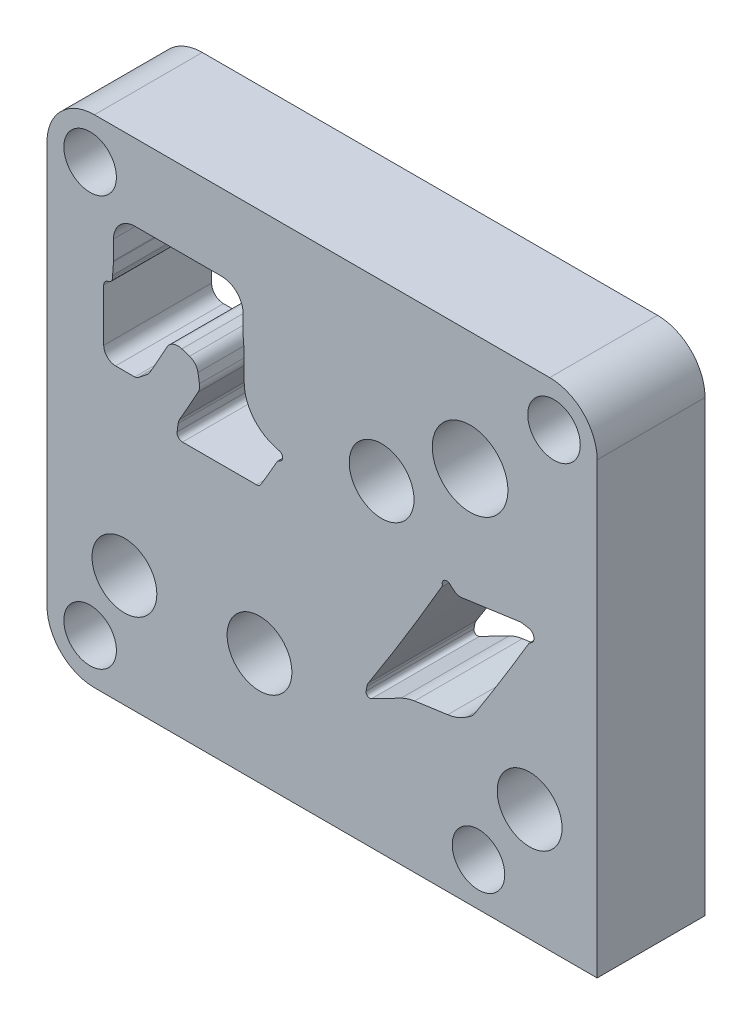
ISO-10303-21;
HEADER;
FILE_DESCRIPTION(('STEP AP214'),'2;1');
FILE_NAME('part.step','',(''),(''),'','','');
FILE_SCHEMA(('AUTOMOTIVE_DESIGN { 1 0 10303 214 1 1 1 1 }'));
ENDSEC;
DATA;
#1=APPLICATION_CONTEXT('core data for automotive mechanical design processes');
#2=APPLICATION_PROTOCOL_DEFINITION('international standard','automotive_design',2000,#1);
#3=PRODUCT_CONTEXT('',#1,'mechanical');
#4=PRODUCT('Part','Part','',(#3));
#5=PRODUCT_RELATED_PRODUCT_CATEGORY('part','',(#4));
#6=PRODUCT_DEFINITION_FORMATION('','',#4);
#7=PRODUCT_DEFINITION_CONTEXT('part definition',#1,'design');
#8=PRODUCT_DEFINITION('design','',#6,#7);
#9=PRODUCT_DEFINITION_SHAPE('','',#8);
#10=(LENGTH_UNIT() NAMED_UNIT(*) SI_UNIT(.MILLI.,.METRE.));
#11=(NAMED_UNIT(*) PLANE_ANGLE_UNIT() SI_UNIT($,.RADIAN.));
#12=(NAMED_UNIT(*) SI_UNIT($,.STERADIAN.) SOLID_ANGLE_UNIT());
#13=UNCERTAINTY_MEASURE_WITH_UNIT(LENGTH_MEASURE(1.E-05),#10,'distance_accuracy_value','');
#14=(GEOMETRIC_REPRESENTATION_CONTEXT(3) GLOBAL_UNCERTAINTY_ASSIGNED_CONTEXT((#13)) GLOBAL_UNIT_ASSIGNED_CONTEXT((#10,
#11,#12)) REPRESENTATION_CONTEXT('',''));
#15=CARTESIAN_POINT('',(0.,0.,0.));
#16=DIRECTION('',(0.,0.,1.));
#17=DIRECTION('',(1.,0.,0.));
#18=AXIS2_PLACEMENT_3D('',#15,#16,#17);
#19=CARTESIAN_POINT('',(-1013.5235,-5.08000000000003,-31.75));
#20=DIRECTION('',(0.,0.,1.));
#21=DIRECTION('',(1.,0.,0.));
#22=AXIS2_PLACEMENT_3D('',#19,#20,#21);
#23=CYLINDRICAL_SURFACE('',#22,13.97);
#24=CARTESIAN_POINT('',(-1013.5235,-5.08000000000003,0.));
#25=DIRECTION('',(0.,0.,1.));
#26=DIRECTION('',(-1.,0.,0.));
#27=AXIS2_PLACEMENT_3D('',#24,#25,#26);
#28=CIRCLE('',#27,13.97);
#29=CARTESIAN_POINT('',(-1027.4935,-5.08000000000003,0.));
#30=VERTEX_POINT('',#29);
#31=CARTESIAN_POINT('',(-1013.5235,-19.05,0.));
#32=VERTEX_POINT('',#31);
#33=EDGE_CURVE('E1436',#30,#32,#28,.T.);
#34=ORIENTED_EDGE('',*,*,#33,.F.);
#35=DIRECTION('',(0.,0.,1.));
#36=VECTOR('',#35,1.);
#37=CARTESIAN_POINT('',(-1027.4935,-5.08000000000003,-31.75));
#38=LINE('',#37,#36);
#39=CARTESIAN_POINT('',(-1027.4935,-5.08000000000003,-31.75));
#40=VERTEX_POINT('',#39);
#41=EDGE_CURVE('E13',#40,#30,#38,.T.);
#42=ORIENTED_EDGE('',*,*,#41,.F.);
#43=CARTESIAN_POINT('',(-1013.5235,-5.08000000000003,-31.75));
#44=DIRECTION('',(0.,0.,1.));
#45=DIRECTION('',(-1.,0.,0.));
#46=AXIS2_PLACEMENT_3D('',#43,#44,#45);
#47=CIRCLE('',#46,13.97);
#48=CARTESIAN_POINT('',(-1013.5235,-19.05,-31.75));
#49=VERTEX_POINT('',#48);
#50=EDGE_CURVE('E1139',#40,#49,#47,.T.);
#51=ORIENTED_EDGE('',*,*,#50,.T.);
#52=DIRECTION('',(0.,0.,1.));
#53=VECTOR('',#52,1.);
#54=CARTESIAN_POINT('',(-1013.5235,-19.05,-31.75));
#55=LINE('',#54,#53);
#56=EDGE_CURVE('E1502',#49,#32,#55,.T.);
#57=ORIENTED_EDGE('',*,*,#56,.T.);
#58=EDGE_LOOP('',(#34,#42,#51,#57));
#59=FACE_BOUND('',#58,.T.);
#60=ADVANCED_FACE('F55',(#59),#23,.T.);
#61=CARTESIAN_POINT('',(-1027.4935,-5.08000000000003,-31.75));
#62=DIRECTION('',(-1.,0.,0.));
#63=DIRECTION('',(0.,0.,1.));
#64=AXIS2_PLACEMENT_3D('',#61,#62,#63);
#65=PLANE('',#64);
#66=DIRECTION('',(0.,-1.,0.));
#67=VECTOR('',#66,1.);
#68=CARTESIAN_POINT('',(-1027.4935,-5.08000000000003,0.));
#69=LINE('',#68,#67);
#70=CARTESIAN_POINT('',(-1027.4935,113.03,0.));
#71=VERTEX_POINT('',#70);
#72=EDGE_CURVE('E1465',#71,#30,#69,.T.);
#73=ORIENTED_EDGE('',*,*,#72,.F.);
#74=DIRECTION('',(0.,0.,1.));
#75=VECTOR('',#74,1.);
#76=CARTESIAN_POINT('',(-1027.4935,113.03,-31.75));
#77=LINE('',#76,#75);
#78=CARTESIAN_POINT('',(-1027.4935,113.03,-31.75));
#79=VERTEX_POINT('',#78);
#80=EDGE_CURVE('E65',#79,#71,#77,.T.);
#81=ORIENTED_EDGE('',*,*,#80,.F.);
#82=DIRECTION('',(0.,-1.,0.));
#83=VECTOR('',#82,1.);
#84=CARTESIAN_POINT('',(-1027.4935,-5.08000000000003,-31.75));
#85=LINE('',#84,#83);
#86=EDGE_CURVE('E1497',#79,#40,#85,.T.);
#87=ORIENTED_EDGE('',*,*,#86,.T.);
#88=ORIENTED_EDGE('',*,*,#41,.T.);
#89=EDGE_LOOP('',(#73,#81,#87,#88));
#90=FACE_BOUND('',#89,.T.);
#91=ADVANCED_FACE('F1299',(#90),#65,.T.);
#92=CARTESIAN_POINT('',(-1013.5235,113.03,-31.75));
#93=DIRECTION('',(0.,0.,1.));
#94=DIRECTION('',(1.,0.,0.));
#95=AXIS2_PLACEMENT_3D('',#92,#93,#94);
#96=CYLINDRICAL_SURFACE('',#95,13.97);
#97=CARTESIAN_POINT('',(-1013.5235,113.03,0.));
#98=DIRECTION('',(0.,0.,1.));
#99=DIRECTION('',(1.,0.,0.));
#100=AXIS2_PLACEMENT_3D('',#97,#98,#99);
#101=CIRCLE('',#100,13.97);
#102=CARTESIAN_POINT('',(-1013.5235,127.,0.));
#103=VERTEX_POINT('',#102);
#104=EDGE_CURVE('E1460',#103,#71,#101,.T.);
#105=ORIENTED_EDGE('',*,*,#104,.F.);
#106=DIRECTION('',(0.,0.,1.));
#107=VECTOR('',#106,1.);
#108=CARTESIAN_POINT('',(-1013.5235,127.,-31.75));
#109=LINE('',#108,#107);
#110=CARTESIAN_POINT('',(-1013.5235,127.,-31.75));
#111=VERTEX_POINT('',#110);
#112=EDGE_CURVE('E1518',#111,#103,#109,.T.);
#113=ORIENTED_EDGE('',*,*,#112,.F.);
#114=CARTESIAN_POINT('',(-1013.5235,113.03,-31.75));
#115=DIRECTION('',(0.,0.,1.));
#116=DIRECTION('',(1.,0.,0.));
#117=AXIS2_PLACEMENT_3D('',#114,#115,#116);
#118=CIRCLE('',#117,13.97);
#119=EDGE_CURVE('E1492',#111,#79,#118,.T.);
#120=ORIENTED_EDGE('',*,*,#119,.T.);
#121=ORIENTED_EDGE('',*,*,#80,.T.);
#122=EDGE_LOOP('',(#105,#113,#120,#121));
#123=FACE_BOUND('',#122,.T.);
#124=ADVANCED_FACE('F1304',(#123),#96,.T.);
#125=CARTESIAN_POINT('',(-879.5385,127.,-31.75));
#126=DIRECTION('',(0.,1.,0.));
#127=DIRECTION('',(-1.,0.,0.));
#128=AXIS2_PLACEMENT_3D('',#125,#126,#127);
#129=PLANE('',#128);
#130=DIRECTION('',(-1.,0.,0.));
#131=VECTOR('',#130,1.);
#132=CARTESIAN_POINT('',(-879.5385,127.,0.));
#133=LINE('',#132,#131);
#134=CARTESIAN_POINT('',(-879.5385,127.,0.));
#135=VERTEX_POINT('',#134);
#136=EDGE_CURVE('E1455',#135,#103,#133,.T.);
#137=ORIENTED_EDGE('',*,*,#136,.F.);
#138=DIRECTION('',(0.,0.,1.));
#139=VECTOR('',#138,1.);
#140=CARTESIAN_POINT('',(-879.5385,127.,-31.75));
#141=LINE('',#140,#139);
#142=CARTESIAN_POINT('',(-879.5385,127.,-31.75));
#143=VERTEX_POINT('',#142);
#144=EDGE_CURVE('E1514',#143,#135,#141,.T.);
#145=ORIENTED_EDGE('',*,*,#144,.F.);
#146=DIRECTION('',(-1.,0.,0.));
#147=VECTOR('',#146,1.);
#148=CARTESIAN_POINT('',(-879.5385,127.,-31.75));
#149=LINE('',#148,#147);
#150=EDGE_CURVE('E1487',#143,#111,#149,.T.);
#151=ORIENTED_EDGE('',*,*,#150,.T.);
#152=ORIENTED_EDGE('',*,*,#112,.T.);
#153=EDGE_LOOP('',(#137,#145,#151,#152));
#154=FACE_BOUND('',#153,.T.);
#155=ADVANCED_FACE('F1320',(#154),#129,.T.);
#156=CARTESIAN_POINT('',(-879.5385,113.03,-31.75));
#157=DIRECTION('',(0.,0.,1.));
#158=DIRECTION('',(1.,0.,0.));
#159=AXIS2_PLACEMENT_3D('',#156,#157,#158);
#160=CYLINDRICAL_SURFACE('',#159,13.97);
#161=CARTESIAN_POINT('',(-879.5385,113.03,0.));
#162=DIRECTION('',(0.,0.,1.));
#163=DIRECTION('',(1.,0.,0.));
#164=AXIS2_PLACEMENT_3D('',#161,#162,#163);
#165=CIRCLE('',#164,13.97);
#166=CARTESIAN_POINT('',(-865.5685,113.03,0.));
#167=VERTEX_POINT('',#166);
#168=EDGE_CURVE('E1450',#167,#135,#165,.T.);
#169=ORIENTED_EDGE('',*,*,#168,.F.);
#170=DIRECTION('',(0.,0.,1.));
#171=VECTOR('',#170,1.);
#172=CARTESIAN_POINT('',(-865.5685,113.03,-31.75));
#173=LINE('',#172,#171);
#174=CARTESIAN_POINT('',(-865.5685,113.03,-31.75));
#175=VERTEX_POINT('',#174);
#176=EDGE_CURVE('E1510',#175,#167,#173,.T.);
#177=ORIENTED_EDGE('',*,*,#176,.F.);
#178=CARTESIAN_POINT('',(-879.5385,113.03,-31.75));
#179=DIRECTION('',(0.,0.,1.));
#180=DIRECTION('',(1.,0.,0.));
#181=AXIS2_PLACEMENT_3D('',#178,#179,#180);
#182=CIRCLE('',#181,13.97);
#183=EDGE_CURVE('E1482',#175,#143,#182,.T.);
#184=ORIENTED_EDGE('',*,*,#183,.T.);
#185=ORIENTED_EDGE('',*,*,#144,.T.);
#186=EDGE_LOOP('',(#169,#177,#184,#185));
#187=FACE_BOUND('',#186,.T.);
#188=ADVANCED_FACE('F1316',(#187),#160,.T.);
#189=CARTESIAN_POINT('',(-865.5685,-19.05,-31.75));
#190=DIRECTION('',(1.,0.,0.));
#191=DIRECTION('',(0.,1.,0.));
#192=AXIS2_PLACEMENT_3D('',#189,#190,#191);
#193=PLANE('',#192);
#194=DIRECTION('',(0.,1.,0.));
#195=VECTOR('',#194,1.);
#196=CARTESIAN_POINT('',(-865.5685,-19.05,0.));
#197=LINE('',#196,#195);
#198=CARTESIAN_POINT('',(-865.5685,-19.05,0.));
#199=VERTEX_POINT('',#198);
#200=EDGE_CURVE('E1445',#199,#167,#197,.T.);
#201=ORIENTED_EDGE('',*,*,#200,.F.);
#202=DIRECTION('',(0.,0.,1.));
#203=VECTOR('',#202,1.);
#204=CARTESIAN_POINT('',(-865.5685,-19.05,-31.75));
#205=LINE('',#204,#203);
#206=CARTESIAN_POINT('',(-865.5685,-19.05,-31.75));
#207=VERTEX_POINT('',#206);
#208=EDGE_CURVE('E1506',#207,#199,#205,.T.);
#209=ORIENTED_EDGE('',*,*,#208,.F.);
#210=DIRECTION('',(0.,1.,0.));
#211=VECTOR('',#210,1.);
#212=CARTESIAN_POINT('',(-865.5685,-19.05,-31.75));
#213=LINE('',#212,#211);
#214=EDGE_CURVE('E1478',#207,#175,#213,.T.);
#215=ORIENTED_EDGE('',*,*,#214,.T.);
#216=ORIENTED_EDGE('',*,*,#176,.T.);
#217=EDGE_LOOP('',(#201,#209,#215,#216));
#218=FACE_BOUND('',#217,.T.);
#219=ADVANCED_FACE('F1312',(#218),#193,.T.);
#220=CARTESIAN_POINT('',(-865.5685,-19.05,-31.75));
#221=DIRECTION('',(0.,-1.,0.));
#222=DIRECTION('',(1.,0.,0.));
#223=AXIS2_PLACEMENT_3D('',#220,#221,#222);
#224=PLANE('',#223);
#225=DIRECTION('',(1.,0.,0.));
#226=VECTOR('',#225,1.);
#227=CARTESIAN_POINT('',(-865.5685,-19.05,0.));
#228=LINE('',#227,#226);
#229=EDGE_CURVE('E1440',#32,#199,#228,.T.);
#230=ORIENTED_EDGE('',*,*,#229,.F.);
#231=ORIENTED_EDGE('',*,*,#56,.F.);
#232=DIRECTION('',(1.,0.,0.));
#233=VECTOR('',#232,1.);
#234=CARTESIAN_POINT('',(-865.5685,-19.05,-31.75));
#235=LINE('',#234,#233);
#236=EDGE_CURVE('E1474',#49,#207,#235,.T.);
#237=ORIENTED_EDGE('',*,*,#236,.T.);
#238=ORIENTED_EDGE('',*,*,#208,.T.);
#239=EDGE_LOOP('',(#230,#231,#237,#238));
#240=FACE_BOUND('',#239,.T.);
#241=ADVANCED_FACE('F1309',(#240),#224,.T.);
#242=CARTESIAN_POINT('',(-1013.5235,-5.08000000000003,-31.75));
#243=DIRECTION('',(0.,0.,-1.));
#244=DIRECTION('',(-1.,0.,0.));
#245=AXIS2_PLACEMENT_3D('',#242,#243,#244);
#246=PLANE('',#245);
#247=CARTESIAN_POINT('',(-1007.29796,69.5960000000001,-31.75));
#248=DIRECTION('',(0.,0.,1.));
#249=DIRECTION('',(-1.,0.,0.));
#250=AXIS2_PLACEMENT_3D('',#247,#248,#249);
#251=CIRCLE('',#250,3.4950400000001);
#252=CARTESIAN_POINT('',(-1010.793,69.5960000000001,-31.75));
#253=VERTEX_POINT('',#252);
#254=CARTESIAN_POINT('',(-1007.29796,66.10096,-31.75));
#255=VERTEX_POINT('',#254);
#256=EDGE_CURVE('E501',#253,#255,#251,.T.);
#257=ORIENTED_EDGE('',*,*,#256,.T.);
#258=DIRECTION('',(1.,0.,0.));
#259=VECTOR('',#258,1.);
#260=CARTESIAN_POINT('',(-1004.697,66.1009600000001,-31.75));
#261=LINE('',#260,#259);
#262=CARTESIAN_POINT('',(-1001.66258489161,66.1009600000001,-31.75));
#263=VERTEX_POINT('',#262);
#264=EDGE_CURVE('E709',#255,#263,#261,.T.);
#265=ORIENTED_EDGE('',*,*,#264,.T.);
#266=CARTESIAN_POINT('',(-1001.66258489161,67.691,-31.75));
#267=DIRECTION('',(0.,0.,1.));
#268=DIRECTION('',(1.,0.,0.));
#269=AXIS2_PLACEMENT_3D('',#266,#267,#268);
#270=CIRCLE('',#269,1.59003999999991);
#271=CARTESIAN_POINT('',(-1000.68443288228,66.4374267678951,-31.75));
#272=VERTEX_POINT('',#271);
#273=EDGE_CURVE('E713',#263,#272,#270,.T.);
#274=ORIENTED_EDGE('',*,*,#273,.T.);
#275=DIRECTION('',(0.788391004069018,0.615174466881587,0.));
#276=VECTOR('',#275,1.);
#277=CARTESIAN_POINT('',(-1000.68443288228,66.4374267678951,-31.75));
#278=LINE('',#277,#276);
#279=CARTESIAN_POINT('',(-998.058569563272,68.4863644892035,-31.75));
#280=VERTEX_POINT('',#279);
#281=EDGE_CURVE('E717',#272,#280,#278,.T.);
#282=ORIENTED_EDGE('',*,*,#281,.T.);
#283=CARTESIAN_POINT('',(-1000.13050177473,71.1416969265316,-31.75));
#284=DIRECTION('',(0.,0.,1.));
#285=DIRECTION('',(1.,0.,0.));
#286=AXIS2_PLACEMENT_3D('',#283,#284,#285);
#287=CIRCLE('',#286,3.36803999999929);
#288=CARTESIAN_POINT('',(-997.201817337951,69.4784167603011,-31.75));
#289=VERTEX_POINT('',#288);
#290=EDGE_CURVE('E721',#280,#289,#287,.T.);
#291=ORIENTED_EDGE('',*,*,#290,.T.);
#292=CARTESIAN_POINT('',(-1733.41846147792,487.596028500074,-31.75));
#293=DIRECTION('',(0.,0.,1.));
#294=DIRECTION('',(1.,0.,0.));
#295=AXIS2_PLACEMENT_3D('',#292,#293,#294);
#296=CIRCLE('',#295,846.662438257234);
#297=CARTESIAN_POINT('',(-992.165153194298,78.4740206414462,-31.75));
#298=VERTEX_POINT('',#297);
#299=EDGE_CURVE('E725',#289,#298,#296,.T.);
#300=ORIENTED_EDGE('',*,*,#299,.T.);
#301=CARTESIAN_POINT('',(-988.94334672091,76.6958000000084,-31.75));
#302=DIRECTION('',(0.,0.,-1.));
#303=DIRECTION('',(1.,0.,0.));
#304=AXIS2_PLACEMENT_3D('',#301,#302,#303);
#305=CIRCLE('',#304,3.67995999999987);
#306=CARTESIAN_POINT('',(-987.784030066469,80.188376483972,-31.75));
#307=VERTEX_POINT('',#306);
#308=EDGE_CURVE('E729',#298,#307,#305,.T.);
#309=ORIENTED_EDGE('',*,*,#308,.T.);
#310=DIRECTION('',(0.949080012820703,-0.315035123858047,0.));
#311=VECTOR('',#310,1.);
#312=CARTESIAN_POINT('',(-987.784030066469,80.188376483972,-31.75));
#313=LINE('',#312,#311);
#314=CARTESIAN_POINT('',(-985.527786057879,79.4394447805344,-31.75));
#315=VERTEX_POINT('',#314);
#316=EDGE_CURVE('E733',#307,#315,#313,.T.);
#317=ORIENTED_EDGE('',*,*,#316,.T.);
#318=CARTESIAN_POINT('',(-986.687102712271,75.9468682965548,-31.75));
#319=DIRECTION('',(0.,0.,-1.));
#320=DIRECTION('',(1.,0.,0.));
#321=AXIS2_PLACEMENT_3D('',#318,#319,#320);
#322=CIRCLE('',#321,3.67995999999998);
#323=CARTESIAN_POINT('',(-983.055927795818,76.5440904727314,-31.75));
#324=VERTEX_POINT('',#323);
#325=EDGE_CURVE('E737',#315,#324,#322,.T.);
#326=ORIENTED_EDGE('',*,*,#325,.T.);
#327=DIRECTION('',(0.162290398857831,-0.986743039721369,0.));
#328=VECTOR('',#327,1.);
#329=CARTESIAN_POINT('',(-983.055927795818,76.5440904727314,-31.75));
#330=LINE('',#329,#328);
#331=CARTESIAN_POINT('',(-982.620339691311,73.895668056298,-31.75));
#332=VERTEX_POINT('',#331);
#333=EDGE_CURVE('E741',#324,#332,#330,.T.);
#334=ORIENTED_EDGE('',*,*,#333,.T.);
#335=CARTESIAN_POINT('',(-986.251514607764,73.2984458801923,-31.75));
#336=DIRECTION('',(0.,0.,-1.));
#337=DIRECTION('',(1.,0.,0.));
#338=AXIS2_PLACEMENT_3D('',#335,#336,#337);
#339=CIRCLE('',#338,3.67995999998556);
#340=CARTESIAN_POINT('',(-983.033197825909,71.5139171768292,-31.75));
#341=VERTEX_POINT('',#340);
#342=EDGE_CURVE('E745',#332,#341,#339,.T.);
#343=ORIENTED_EDGE('',*,*,#342,.T.);
#344=CARTESIAN_POINT('',(-1733.41846147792,487.596028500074,-31.75));
#345=DIRECTION('',(0.,0.,-1.));
#346=DIRECTION('',(1.,0.,0.));
#347=AXIS2_PLACEMENT_3D('',#344,#345,#346);
#348=CIRCLE('',#347,858.022358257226);
#349=CARTESIAN_POINT('',(-988.476885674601,61.8444390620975,-31.75));
#350=VERTEX_POINT('',#349);
#351=EDGE_CURVE('E749',#341,#350,#348,.T.);
#352=ORIENTED_EDGE('',*,*,#351,.T.);
#353=CARTESIAN_POINT('',(-985.552727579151,60.17321409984,-31.75));
#354=DIRECTION('',(0.,0.,1.));
#355=DIRECTION('',(1.,0.,0.));
#356=AXIS2_PLACEMENT_3D('',#353,#354,#355);
#357=CIRCLE('',#356,3.36804000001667);
#358=CARTESIAN_POINT('',(-988.892805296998,60.6063125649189,-31.75));
#359=VERTEX_POINT('',#358);
#360=EDGE_CURVE('E753',#350,#359,#357,.T.);
#361=ORIENTED_EDGE('',*,*,#360,.T.);
#362=DIRECTION('',(-0.128590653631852,-0.991697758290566,0.));
#363=VECTOR('',#362,1.);
#364=CARTESIAN_POINT('',(-988.892805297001,60.6063125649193,-31.75));
#365=LINE('',#364,#363);
#366=CARTESIAN_POINT('',(-989.188237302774,58.3279256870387,-31.75));
#367=VERTEX_POINT('',#366);
#368=EDGE_CURVE('E757',#359,#367,#365,.T.);
#369=ORIENTED_EDGE('',*,*,#368,.T.);
#370=CARTESIAN_POINT('',(-987.611398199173,58.123461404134,-31.75));
#371=DIRECTION('',(0.,0.,1.));
#372=DIRECTION('',(1.,0.,0.));
#373=AXIS2_PLACEMENT_3D('',#370,#371,#372);
#374=CIRCLE('',#373,1.59004000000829);
#375=CARTESIAN_POINT('',(-987.611398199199,56.5334214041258,-31.75));
#376=VERTEX_POINT('',#375);
#377=EDGE_CURVE('E761',#367,#376,#374,.T.);
#378=ORIENTED_EDGE('',*,*,#377,.T.);
#379=DIRECTION('',(1.,1.54096133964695E-13,0.));
#380=VECTOR('',#379,1.);
#381=CARTESIAN_POINT('',(-987.611398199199,56.5334214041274,-31.75));
#382=LINE('',#381,#380);
#383=CARTESIAN_POINT('',(-965.862080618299,56.5334214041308,-31.75));
#384=VERTEX_POINT('',#383);
#385=EDGE_CURVE('E765',#376,#384,#382,.T.);
#386=ORIENTED_EDGE('',*,*,#385,.T.);
#387=CARTESIAN_POINT('',(-965.862080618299,58.123461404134,-31.75));
#388=DIRECTION('',(0.,0.,1.));
#389=DIRECTION('',(1.,0.,0.));
#390=AXIS2_PLACEMENT_3D('',#387,#388,#389);
#391=CIRCLE('',#390,1.59004000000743);
#392=CARTESIAN_POINT('',(-964.492683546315,57.3153903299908,-31.75));
#393=VERTEX_POINT('',#392);
#394=EDGE_CURVE('E769',#384,#393,#391,.T.);
#395=ORIENTED_EDGE('',*,*,#394,.T.);
#396=CARTESIAN_POINT('',(-1693.66746147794,487.596028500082,-31.75));
#397=DIRECTION('',(0.,0.,1.));
#398=DIRECTION('',(1.,0.,0.));
#399=AXIS2_PLACEMENT_3D('',#396,#397,#398);
#400=CIRCLE('',#399,846.662438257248);
#401=CARTESIAN_POINT('',(-959.744781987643,65.4647871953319,-31.75));
#402=VERTEX_POINT('',#401);
#403=EDGE_CURVE('E773',#393,#402,#400,.T.);
#404=ORIENTED_EDGE('',*,*,#403,.T.);
#405=CARTESIAN_POINT('',(-958.70113872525,64.8645135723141,-31.75));
#406=DIRECTION('',(0.,0.,-1.));
#407=DIRECTION('',(1.,0.,0.));
#408=AXIS2_PLACEMENT_3D('',#405,#406,#407);
#409=CIRCLE('',#408,1.20396000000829);
#410=CARTESIAN_POINT('',(-959.058000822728,66.0143697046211,-31.75));
#411=VERTEX_POINT('',#410);
#412=EDGE_CURVE('E777',#402,#411,#409,.T.);
#413=ORIENTED_EDGE('',*,*,#412,.T.);
#414=CARTESIAN_POINT('',(-959.44926983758,67.2750894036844,-31.75));
#415=DIRECTION('',(0.,0.,1.));
#416=DIRECTION('',(1.,0.,0.));
#417=AXIS2_PLACEMENT_3D('',#414,#415,#416);
#418=CIRCLE('',#417,1.32003999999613);
#419=CARTESIAN_POINT('',(-959.06112639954,68.5367748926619,-31.75));
#420=VERTEX_POINT('',#419);
#421=EDGE_CURVE('E781',#411,#420,#418,.T.);
#422=ORIENTED_EDGE('',*,*,#421,.T.);
#423=DIRECTION('',(-0.955793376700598,0.29403914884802,0.));
#424=VECTOR('',#423,1.);
#425=CARTESIAN_POINT('',(-959.06112639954,68.5367748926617,-31.75));
#426=LINE('',#425,#424);
#427=CARTESIAN_POINT('',(-960.712192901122,69.0447070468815,-31.75));
#428=VERTEX_POINT('',#427);
#429=EDGE_CURVE('E785',#420,#428,#426,.T.);
#430=ORIENTED_EDGE('',*,*,#429,.T.);
#431=CARTESIAN_POINT('',(-957.072,80.8773908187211,-31.75));
#432=DIRECTION('',(0.,0.,-1.));
#433=DIRECTION('',(1.,0.,0.));
#434=AXIS2_PLACEMENT_3D('',#431,#432,#433);
#435=CIRCLE('',#434,12.3799600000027);
#436=CARTESIAN_POINT('',(-969.45196,80.8773908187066,-31.75));
#437=VERTEX_POINT('',#436);
#438=EDGE_CURVE('E658',#428,#437,#435,.T.);
#439=ORIENTED_EDGE('',*,*,#438,.T.);
#440=DIRECTION('',(0.,1.,0.));
#441=VECTOR('',#440,1.);
#442=CARTESIAN_POINT('',(-969.45196,88.5038029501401,-31.75));
#443=LINE('',#442,#441);
#444=CARTESIAN_POINT('',(-969.45196,88.5038029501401,-31.75));
#445=VERTEX_POINT('',#444);
#446=EDGE_CURVE('E662',#437,#445,#443,.T.);
#447=ORIENTED_EDGE('',*,*,#446,.T.);
#448=CARTESIAN_POINT('',(-973.13496,88.5038029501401,-31.75));
#449=DIRECTION('',(0.,0.,1.));
#450=DIRECTION('',(1.,0.,0.));
#451=AXIS2_PLACEMENT_3D('',#448,#449,#450);
#452=CIRCLE('',#451,3.68299999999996);
#453=CARTESIAN_POINT('',(-969.462923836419,88.7877737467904,-31.75));
#454=VERTEX_POINT('',#453);
#455=EDGE_CURVE('E81',#445,#454,#452,.T.);
#456=ORIENTED_EDGE('',*,*,#455,.T.);
#457=DIRECTION('',(-0.0771031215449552,0.997023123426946,0.));
#458=VECTOR('',#457,1.);
#459=CARTESIAN_POINT('',(-969.735636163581,92.3142262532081,-31.75));
#460=LINE('',#459,#458);
#461=CARTESIAN_POINT('',(-969.735636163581,92.3142262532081,-31.75));
#462=VERTEX_POINT('',#461);
#463=EDGE_CURVE('E668',#454,#462,#460,.T.);
#464=ORIENTED_EDGE('',*,*,#463,.T.);
#465=CARTESIAN_POINT('',(-966.0636,92.5981970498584,-31.75));
#466=DIRECTION('',(0.,0.,-1.));
#467=DIRECTION('',(1.,0.,0.));
#468=AXIS2_PLACEMENT_3D('',#465,#466,#467);
#469=CIRCLE('',#468,3.68299999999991);
#470=CARTESIAN_POINT('',(-969.7466,92.5981970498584,-31.75));
#471=VERTEX_POINT('',#470);
#472=EDGE_CURVE('E672',#462,#471,#469,.T.);
#473=ORIENTED_EDGE('',*,*,#472,.T.);
#474=DIRECTION('',(0.,1.,0.));
#475=VECTOR('',#474,1.);
#476=CARTESIAN_POINT('',(-969.7466,98.1709999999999,-31.75));
#477=LINE('',#476,#475);
#478=CARTESIAN_POINT('',(-969.7466,98.1709999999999,-31.75));
#479=VERTEX_POINT('',#478);
#480=EDGE_CURVE('E676',#471,#479,#477,.T.);
#481=ORIENTED_EDGE('',*,*,#480,.T.);
#482=CARTESIAN_POINT('',(-976.122,98.171,-31.75));
#483=DIRECTION('',(0.,0.,1.));
#484=DIRECTION('',(1.,0.,0.));
#485=AXIS2_PLACEMENT_3D('',#482,#483,#484);
#486=CIRCLE('',#485,6.37539999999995);
#487=CARTESIAN_POINT('',(-976.122,104.5464,-31.75));
#488=VERTEX_POINT('',#487);
#489=EDGE_CURVE('E680',#479,#488,#486,.T.);
#490=ORIENTED_EDGE('',*,*,#489,.T.);
#491=DIRECTION('',(-1.,0.,0.));
#492=VECTOR('',#491,1.);
#493=CARTESIAN_POINT('',(-976.122,104.5464,-31.75));
#494=LINE('',#493,#492);
#495=CARTESIAN_POINT('',(-1001.522,104.5464,-31.75));
#496=VERTEX_POINT('',#495);
#497=EDGE_CURVE('E684',#488,#496,#494,.T.);
#498=ORIENTED_EDGE('',*,*,#497,.T.);
#499=CARTESIAN_POINT('',(-1001.522,98.171,-31.75));
#500=DIRECTION('',(0.,0.,1.));
#501=DIRECTION('',(1.,0.,0.));
#502=AXIS2_PLACEMENT_3D('',#499,#500,#501);
#503=CIRCLE('',#502,6.37540000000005);
#504=CARTESIAN_POINT('',(-1007.8974,98.1709999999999,-31.75));
#505=VERTEX_POINT('',#504);
#506=EDGE_CURVE('E688',#496,#505,#503,.T.);
#507=ORIENTED_EDGE('',*,*,#506,.T.);
#508=DIRECTION('',(0.,-1.,0.));
#509=VECTOR('',#508,1.);
#510=CARTESIAN_POINT('',(-1007.8974,92.5981970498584,-31.75));
#511=LINE('',#510,#509);
#512=CARTESIAN_POINT('',(-1007.8974,92.5981970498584,-31.75));
#513=VERTEX_POINT('',#512);
#514=EDGE_CURVE('E692',#505,#513,#511,.T.);
#515=ORIENTED_EDGE('',*,*,#514,.T.);
#516=CARTESIAN_POINT('',(-1011.5804,92.5981970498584,-31.75));
#517=DIRECTION('',(0.,0.,-1.));
#518=DIRECTION('',(-1.,0.,0.));
#519=AXIS2_PLACEMENT_3D('',#516,#517,#518);
#520=CIRCLE('',#519,3.68300000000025);
#521=CARTESIAN_POINT('',(-1007.90836383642,92.3142262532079,-31.75));
#522=VERTEX_POINT('',#521);
#523=EDGE_CURVE('E696',#513,#522,#520,.T.);
#524=ORIENTED_EDGE('',*,*,#523,.T.);
#525=DIRECTION('',(-0.0771031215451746,-0.997023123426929,0.));
#526=VECTOR('',#525,1.);
#527=CARTESIAN_POINT('',(-1008.18107616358,88.7877737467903,-31.75));
#528=LINE('',#527,#526);
#529=CARTESIAN_POINT('',(-1008.18107616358,88.7877737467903,-31.75));
#530=VERTEX_POINT('',#529);
#531=EDGE_CURVE('E700',#522,#530,#528,.T.);
#532=ORIENTED_EDGE('',*,*,#531,.T.);
#533=CARTESIAN_POINT('',(-1004.50904,88.5038029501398,-31.75));
#534=DIRECTION('',(0.,0.,1.));
#535=DIRECTION('',(-1.,0.,0.));
#536=AXIS2_PLACEMENT_3D('',#533,#534,#535);
#537=CIRCLE('',#536,3.68300000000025);
#538=CARTESIAN_POINT('',(-1008.19204,88.5038029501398,-31.75));
#539=VERTEX_POINT('',#538);
#540=EDGE_CURVE('E704',#530,#539,#537,.T.);
#541=ORIENTED_EDGE('',*,*,#540,.T.);
#542=DIRECTION('',(0.,-1.,0.));
#543=VECTOR('',#542,1.);
#544=CARTESIAN_POINT('',(-1008.19204,69.596,-31.75));
#545=LINE('',#544,#543);
#546=CARTESIAN_POINT('',(-1008.19204,88.0856756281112,-31.75));
#547=VERTEX_POINT('',#546);
#548=EDGE_CURVE('E489',#539,#547,#545,.T.);
#549=ORIENTED_EDGE('',*,*,#548,.T.);
#550=CARTESIAN_POINT('',(-1009.77954,88.0856756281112,-31.75));
#551=DIRECTION('',(0.,0.,-1.));
#552=DIRECTION('',(1.,0.,0.));
#553=AXIS2_PLACEMENT_3D('',#550,#551,#552);
#554=CIRCLE('',#553,1.58749999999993);
#555=CARTESIAN_POINT('',(-1009.49252,86.5243378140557,-31.75));
#556=VERTEX_POINT('',#555);
#557=EDGE_CURVE('E73',#547,#556,#554,.T.);
#558=ORIENTED_EDGE('',*,*,#557,.T.);
#559=CARTESIAN_POINT('',(-1009.2055,84.963,-31.75));
#560=DIRECTION('',(0.,0.,1.));
#561=DIRECTION('',(1.,0.,0.));
#562=AXIS2_PLACEMENT_3D('',#559,#560,#561);
#563=CIRCLE('',#562,1.58750000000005);
#564=CARTESIAN_POINT('',(-1010.793,84.963,-31.75));
#565=VERTEX_POINT('',#564);
#566=EDGE_CURVE('E475',#556,#565,#563,.T.);
#567=ORIENTED_EDGE('',*,*,#566,.T.);
#568=DIRECTION('',(0.,-1.,0.));
#569=VECTOR('',#568,1.);
#570=CARTESIAN_POINT('',(-1010.793,84.963,-31.75));
#571=LINE('',#570,#569);
#572=EDGE_CURVE('E481',#565,#253,#571,.T.);
#573=ORIENTED_EDGE('',*,*,#572,.T.);
#574=EDGE_LOOP('',(#257,#265,#274,#282,#291,#300,#309,#317,#326,#334,#343,#352,#361,#369,#378,
#386,#395,#404,#413,#422,#430,#439,#447,#456,#464,#473,#481,#490,#498,#507,#515,#524,#532,#541,
#549,#558,#567,#573));
#575=FACE_BOUND('',#574,.T.);
#576=CARTESIAN_POINT('',(-1653.91646147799,487.596028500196,-31.75));
#577=DIRECTION('',(0.,0.,-1.));
#578=DIRECTION('',(1.,0.,0.));
#579=AXIS2_PLACEMENT_3D('',#576,#577,#578);
#580=CIRCLE('',#579,858.022358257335);
#581=CARTESIAN_POINT('',(-911.31042214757,57.7837001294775,-31.75));
#582=VERTEX_POINT('',#581);
#583=CARTESIAN_POINT('',(-932.854126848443,22.5460560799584,-31.75));
#584=VERTEX_POINT('',#583);
#585=EDGE_CURVE('E968',#582,#584,#580,.T.);
#586=ORIENTED_EDGE('',*,*,#585,.T.);
#587=CARTESIAN_POINT('',(-930.023703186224,20.7205711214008,-31.75));
#588=DIRECTION('',(0.,0.,1.));
#589=DIRECTION('',(1.,0.,0.));
#590=AXIS2_PLACEMENT_3D('',#587,#588,#589);
#591=CIRCLE('',#590,3.36803999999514);
#592=CARTESIAN_POINT('',(-933.335781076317,21.3319903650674,-31.75));
#593=VERTEX_POINT('',#592);
#594=EDGE_CURVE('E972',#584,#593,#591,.T.);
#595=ORIENTED_EDGE('',*,*,#594,.T.);
#596=DIRECTION('',(-0.181535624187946,-0.98338436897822,0.));
#597=VECTOR('',#596,1.);
#598=CARTESIAN_POINT('',(-933.335781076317,21.3319903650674,-31.75));
#599=LINE('',#598,#597);
#600=CARTESIAN_POINT('',(-933.568061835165,20.0737179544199,-31.75));
#601=VERTEX_POINT('',#600);
#602=EDGE_CURVE('E976',#593,#601,#599,.T.);
#603=ORIENTED_EDGE('',*,*,#602,.T.);
#604=CARTESIAN_POINT('',(-932.504000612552,19.877289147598,-31.75));
#605=DIRECTION('',(0.,0.,1.));
#606=DIRECTION('',(1.,0.,0.));
#607=AXIS2_PLACEMENT_3D('',#604,#605,#606);
#608=CIRCLE('',#607,1.08204000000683);
#609=CARTESIAN_POINT('',(-932.007273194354,18.9160022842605,-31.75));
#610=VERTEX_POINT('',#609);
#611=EDGE_CURVE('E980',#601,#610,#608,.T.);
#612=ORIENTED_EDGE('',*,*,#611,.T.);
#613=DIRECTION('',(0.888402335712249,0.459065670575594,0.));
#614=VECTOR('',#613,1.);
#615=CARTESIAN_POINT('',(-932.007273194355,18.9160022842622,-31.75));
#616=LINE('',#615,#614);
#617=CARTESIAN_POINT('',(-923.257211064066,23.4374369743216,-31.75));
#618=VERTEX_POINT('',#617);
#619=EDGE_CURVE('E984',#610,#618,#616,.T.);
#620=ORIENTED_EDGE('',*,*,#619,.T.);
#621=CARTESIAN_POINT('',(-917.573996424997,12.439051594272,-31.75));
#622=DIRECTION('',(0.,0.,-1.));
#623=DIRECTION('',(1.,0.,0.));
#624=AXIS2_PLACEMENT_3D('',#621,#622,#623);
#625=CIRCLE('',#624,12.3799600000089);
#626=CARTESIAN_POINT('',(-919.29695384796,24.6985306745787,-31.75));
#627=VERTEX_POINT('',#626);
#628=EDGE_CURVE('E988',#618,#627,#625,.T.);
#629=ORIENTED_EDGE('',*,*,#628,.T.);
#630=DIRECTION('',(0.990268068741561,0.139173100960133,0.));
#631=VECTOR('',#630,1.);
#632=CARTESIAN_POINT('',(-919.29695384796,24.6985306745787,-31.75));
#633=LINE('',#632,#631);
#634=CARTESIAN_POINT('',(-909.543594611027,26.0692759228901,-31.75));
#635=VERTEX_POINT('',#634);
#636=EDGE_CURVE('E992',#627,#635,#633,.T.);
#637=ORIENTED_EDGE('',*,*,#636,.T.);
#638=CARTESIAN_POINT('',(-911.355633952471,38.9626057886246,-31.75));
#639=DIRECTION('',(0.,0.,1.));
#640=DIRECTION('',(1.,0.,0.));
#641=AXIS2_PLACEMENT_3D('',#638,#639,#640);
#642=CIRCLE('',#641,13.0200399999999);
#643=CARTESIAN_POINT('',(-903.915629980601,28.2776732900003,-31.75));
#644=VERTEX_POINT('',#643);
#645=EDGE_CURVE('E996',#635,#644,#642,.T.);
#646=ORIENTED_EDGE('',*,*,#645,.T.);
#647=DIRECTION('',(0.820652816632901,0.571427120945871,0.));
#648=VECTOR('',#647,1.);
#649=CARTESIAN_POINT('',(-903.915629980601,28.2776732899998,-31.75));
#650=LINE('',#649,#648);
#651=CARTESIAN_POINT('',(-902.664955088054,29.1485282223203,-31.75));
#652=VERTEX_POINT('',#651);
#653=EDGE_CURVE('E1000',#644,#652,#650,.T.);
#654=ORIENTED_EDGE('',*,*,#653,.T.);
#655=CARTESIAN_POINT('',(-904.589544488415,31.912519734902,-31.75));
#656=DIRECTION('',(0.,0.,1.));
#657=DIRECTION('',(1.,0.,0.));
#658=AXIS2_PLACEMENT_3D('',#655,#656,#657);
#659=CIRCLE('',#658,3.36804000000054);
#660=CARTESIAN_POINT('',(-901.755563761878,30.0925618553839,-31.75));
#661=VERTEX_POINT('',#660);
#662=EDGE_CURVE('E1004',#652,#661,#659,.T.);
#663=ORIENTED_EDGE('',*,*,#662,.T.);
#664=CARTESIAN_POINT('',(-1614.16546147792,487.596028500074,-31.75));
#665=DIRECTION('',(0.,0.,1.));
#666=DIRECTION('',(1.,0.,0.));
#667=AXIS2_PLACEMENT_3D('',#664,#665,#666);
#668=CIRCLE('',#667,846.662438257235);
#669=CARTESIAN_POINT('',(-885.711814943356,56.0956586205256,-31.75));
#670=VERTEX_POINT('',#669);
#671=EDGE_CURVE('E1008',#661,#670,#668,.T.);
#672=ORIENTED_EDGE('',*,*,#671,.T.);
#673=CARTESIAN_POINT('',(-884.675948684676,55.4820620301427,-31.75));
#674=DIRECTION('',(0.,0.,-1.));
#675=DIRECTION('',(1.,0.,0.));
#676=AXIS2_PLACEMENT_3D('',#673,#674,#675);
#677=CIRCLE('',#676,1.20395999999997);
#678=CARTESIAN_POINT('',(-885.201069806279,56.5654675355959,-31.75));
#679=VERTEX_POINT('',#678);
#680=EDGE_CURVE('E1012',#670,#679,#677,.T.);
#681=ORIENTED_EDGE('',*,*,#680,.T.);
#682=CARTESIAN_POINT('',(-886.005369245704,58.2248607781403,-31.75));
#683=DIRECTION('',(0.,0.,1.));
#684=DIRECTION('',(1.,0.,0.));
#685=AXIS2_PLACEMENT_3D('',#682,#683,#684);
#686=CIRCLE('',#685,1.84404000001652);
#687=CARTESIAN_POINT('',(-885.685155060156,60.0408856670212,-31.75));
#688=VERTEX_POINT('',#687);
#689=EDGE_CURVE('E1016',#679,#688,#686,.T.);
#690=ORIENTED_EDGE('',*,*,#689,.T.);
#691=DIRECTION('',(-0.984807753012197,0.173648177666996,0.));
#692=VECTOR('',#691,1.);
#693=CARTESIAN_POINT('',(-885.685155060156,60.0408856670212,-31.75));
#694=LINE('',#693,#692);
#695=CARTESIAN_POINT('',(-887.369848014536,60.337942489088,-31.75));
#696=VERTEX_POINT('',#695);
#697=EDGE_CURVE('E1020',#688,#696,#694,.T.);
#698=ORIENTED_EDGE('',*,*,#697,.T.);
#699=CARTESIAN_POINT('',(-887.976755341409,56.896,-31.75));
#700=DIRECTION('',(0.,0.,1.));
#701=DIRECTION('',(1.,0.,0.));
#702=AXIS2_PLACEMENT_3D('',#699,#700,#701);
#703=CIRCLE('',#702,3.49504000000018);
#704=CARTESIAN_POINT('',(-888.463170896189,60.3570265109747,-31.75));
#705=VERTEX_POINT('',#704);
#706=EDGE_CURVE('E1024',#696,#705,#703,.T.);
#707=ORIENTED_EDGE('',*,*,#706,.T.);
#708=DIRECTION('',(-0.990268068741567,-0.139173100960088,0.));
#709=VECTOR('',#708,1.);
#710=CARTESIAN_POINT('',(-888.463170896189,60.3570265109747,-31.75));
#711=LINE('',#710,#709);
#712=CARTESIAN_POINT('',(-905.419428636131,57.973979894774,-31.75));
#713=VERTEX_POINT('',#712);
#714=EDGE_CURVE('E1028',#705,#713,#711,.T.);
#715=ORIENTED_EDGE('',*,*,#714,.T.);
#716=CARTESIAN_POINT('',(-905.816762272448,60.8011556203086,-31.75));
#717=DIRECTION('',(0.,0.,-1.));
#718=DIRECTION('',(1.,0.,0.));
#719=AXIS2_PLACEMENT_3D('',#716,#717,#718);
#720=CIRCLE('',#719,2.85496000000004);
#721=CARTESIAN_POINT('',(-907.639750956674,58.6039963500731,-31.75));
#722=VERTEX_POINT('',#721);
#723=EDGE_CURVE('E1032',#713,#722,#720,.T.);
#724=ORIENTED_EDGE('',*,*,#723,.T.);
#725=DIRECTION('',(-0.769593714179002,0.638533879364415,0.));
#726=VECTOR('',#725,1.);
#727=CARTESIAN_POINT('',(-907.639750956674,58.6039963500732,-31.75));
#728=LINE('',#727,#726);
#729=CARTESIAN_POINT('',(-909.008088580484,59.7393095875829,-31.75));
#730=VERTEX_POINT('',#729);
#731=EDGE_CURVE('E1036',#722,#730,#728,.T.);
#732=ORIENTED_EDGE('',*,*,#731,.T.);
#733=CARTESIAN_POINT('',(-909.850978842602,58.7234151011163,-31.75));
#734=DIRECTION('',(0.,0.,1.));
#735=DIRECTION('',(1.,0.,0.));
#736=AXIS2_PLACEMENT_3D('',#733,#734,#735);
#737=CIRCLE('',#736,1.32004000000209);
#738=CARTESIAN_POINT('',(-911.159227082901,58.5473692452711,-31.75));
#739=VERTEX_POINT('',#738);
#740=EDGE_CURVE('E1040',#730,#739,#737,.T.);
#741=ORIENTED_EDGE('',*,*,#740,.T.);
#742=CARTESIAN_POINT('',(-912.35243225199,58.3868042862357,-31.75));
#743=DIRECTION('',(0.,0.,-1.));
#744=DIRECTION('',(1.,0.,0.));
#745=AXIS2_PLACEMENT_3D('',#742,#743,#744);
#746=CIRCLE('',#745,1.20396000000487);
#747=EDGE_CURVE('E1044',#739,#582,#746,.T.);
#748=ORIENTED_EDGE('',*,*,#747,.T.);
#749=EDGE_LOOP('',(#586,#595,#603,#612,#620,#629,#637,#646,#654,#663,#672,#681,#690,#698,#707,
#715,#724,#732,#741,#748));
#750=FACE_BOUND('',#749,.T.);
#751=CARTESIAN_POINT('',(-900.4935,-6.34999999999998,-31.75));
#752=DIRECTION('',(0.,0.,1.));
#753=DIRECTION('',(1.,0.,0.));
#754=AXIS2_PLACEMENT_3D('',#751,#752,#753);
#755=CIRCLE('',#754,5.15619999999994);
#756=CARTESIAN_POINT('',(-895.3373,-6.34999999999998,-31.75));
#757=VERTEX_POINT('',#756);
#758=EDGE_CURVE('E1052',#757,#757,#755,.T.);
#759=ORIENTED_EDGE('',*,*,#758,.T.);
#760=EDGE_LOOP('',(#759));
#761=FACE_BOUND('',#760,.T.);
#762=CARTESIAN_POINT('',(-878.2685,114.3,-31.75));
#763=DIRECTION('',(0.,0.,1.));
#764=DIRECTION('',(1.,0.,0.));
#765=AXIS2_PLACEMENT_3D('',#762,#763,#764);
#766=CIRCLE('',#765,5.15619999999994);
#767=CARTESIAN_POINT('',(-873.1123,114.3,-31.75));
#768=VERTEX_POINT('',#767);
#769=EDGE_CURVE('E1257',#768,#768,#766,.T.);
#770=ORIENTED_EDGE('',*,*,#769,.T.);
#771=EDGE_LOOP('',(#770));
#772=FACE_BOUND('',#771,.T.);
#773=CARTESIAN_POINT('',(-1014.7935,114.3,-31.75));
#774=DIRECTION('',(0.,0.,1.));
#775=DIRECTION('',(1.,0.,0.));
#776=AXIS2_PLACEMENT_3D('',#773,#774,#775);
#777=CIRCLE('',#776,5.15620000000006);
#778=CARTESIAN_POINT('',(-1009.6373,114.3,-31.75));
#779=VERTEX_POINT('',#778);
#780=EDGE_CURVE('E1232',#779,#779,#777,.T.);
#781=ORIENTED_EDGE('',*,*,#780,.T.);
#782=EDGE_LOOP('',(#781));
#783=FACE_BOUND('',#782,.T.);
#784=CARTESIAN_POINT('',(-1014.7935,-6.34999999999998,-31.75));
#785=DIRECTION('',(0.,0.,1.));
#786=DIRECTION('',(1.,0.,0.));
#787=AXIS2_PLACEMENT_3D('',#784,#785,#786);
#788=CIRCLE('',#787,5.15620000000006);
#789=CARTESIAN_POINT('',(-1009.6373,-6.34999999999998,-31.75));
#790=VERTEX_POINT('',#789);
#791=EDGE_CURVE('E1206',#790,#790,#788,.T.);
#792=ORIENTED_EDGE('',*,*,#791,.T.);
#793=EDGE_LOOP('',(#792));
#794=FACE_BOUND('',#793,.T.);
#795=CARTESIAN_POINT('',(-1004.697,13.97,-31.75));
#796=DIRECTION('',(0.,0.,1.));
#797=DIRECTION('',(1.,0.,0.));
#798=AXIS2_PLACEMENT_3D('',#795,#796,#797);
#799=CIRCLE('',#798,9.53769999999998);
#800=CARTESIAN_POINT('',(-995.1593,13.97,-31.75));
#801=VERTEX_POINT('',#800);
#802=EDGE_CURVE('E1180',#801,#801,#799,.T.);
#803=ORIENTED_EDGE('',*,*,#802,.T.);
#804=EDGE_LOOP('',(#803));
#805=FACE_BOUND('',#804,.T.);
#806=CARTESIAN_POINT('',(-964.946,13.97,-31.75));
#807=DIRECTION('',(0.,0.,1.));
#808=DIRECTION('',(1.,0.,0.));
#809=AXIS2_PLACEMENT_3D('',#806,#807,#808);
#810=CIRCLE('',#809,9.53769999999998);
#811=CARTESIAN_POINT('',(-955.4083,13.97,-31.75));
#812=VERTEX_POINT('',#811);
#813=EDGE_CURVE('E1167',#812,#812,#810,.T.);
#814=ORIENTED_EDGE('',*,*,#813,.T.);
#815=EDGE_LOOP('',(#814));
#816=FACE_BOUND('',#815,.T.);
#817=CARTESIAN_POINT('',(-885.444,13.97,-31.75));
#818=DIRECTION('',(0.,0.,1.));
#819=DIRECTION('',(1.,0.,0.));
#820=AXIS2_PLACEMENT_3D('',#817,#818,#819);
#821=CIRCLE('',#820,9.53769999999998);
#822=CARTESIAN_POINT('',(-875.9063,13.97,-31.75));
#823=VERTEX_POINT('',#822);
#824=EDGE_CURVE('E1152',#823,#823,#821,.T.);
#825=ORIENTED_EDGE('',*,*,#824,.T.);
#826=EDGE_LOOP('',(#825));
#827=FACE_BOUND('',#826,.T.);
#828=CARTESIAN_POINT('',(-929.005,75.8952,-31.75));
#829=DIRECTION('',(0.,0.,1.));
#830=DIRECTION('',(1.,0.,0.));
#831=AXIS2_PLACEMENT_3D('',#828,#829,#830);
#832=CIRCLE('',#831,9.53769999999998);
#833=CARTESIAN_POINT('',(-919.4673,75.8952,-31.75));
#834=VERTEX_POINT('',#833);
#835=EDGE_CURVE('E1137',#834,#834,#832,.T.);
#836=ORIENTED_EDGE('',*,*,#835,.T.);
#837=EDGE_LOOP('',(#836));
#838=FACE_BOUND('',#837,.T.);
#839=CARTESIAN_POINT('',(-902.97,92.075,-31.75));
#840=DIRECTION('',(0.,0.,-1.));
#841=DIRECTION('',(-1.,0.,0.));
#842=AXIS2_PLACEMENT_3D('',#839,#840,#841);
#843=CIRCLE('',#842,11.1252);
#844=CARTESIAN_POINT('',(-914.0952,92.075,-31.75));
#845=VERTEX_POINT('',#844);
#846=EDGE_CURVE('E1136',#845,#845,#843,.F.);
#847=ORIENTED_EDGE('',*,*,#846,.T.);
#848=EDGE_LOOP('',(#847));
#849=FACE_BOUND('',#848,.T.);
#850=ORIENTED_EDGE('',*,*,#50,.F.);
#851=ORIENTED_EDGE('',*,*,#86,.F.);
#852=ORIENTED_EDGE('',*,*,#119,.F.);
#853=ORIENTED_EDGE('',*,*,#150,.F.);
#854=ORIENTED_EDGE('',*,*,#183,.F.);
#855=ORIENTED_EDGE('',*,*,#214,.F.);
#856=ORIENTED_EDGE('',*,*,#236,.F.);
#857=EDGE_LOOP('',(#850,#851,#852,#853,#854,#855,#856));
#858=FACE_BOUND('',#857,.T.);
#859=ADVANCED_FACE('F485',(#575,#750,#761,#772,#783,#794,#805,#816,#827,#838,#849,#858),#246,.T.);
#860=CARTESIAN_POINT('',(-1013.5235,-5.08000000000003,0.));
#861=DIRECTION('',(0.,0.,-1.));
#862=DIRECTION('',(-1.,0.,0.));
#863=AXIS2_PLACEMENT_3D('',#860,#861,#862);
#864=PLANE('',#863);
#865=DIRECTION('',(1.,0.,0.));
#866=VECTOR('',#865,1.);
#867=CARTESIAN_POINT('',(-1004.697,66.1009600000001,0.));
#868=LINE('',#867,#866);
#869=CARTESIAN_POINT('',(-1007.29796,66.10096,0.));
#870=VERTEX_POINT('',#869);
#871=CARTESIAN_POINT('',(-1001.66258489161,66.1009600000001,0.));
#872=VERTEX_POINT('',#871);
#873=EDGE_CURVE('E578',#870,#872,#868,.T.);
#874=ORIENTED_EDGE('',*,*,#873,.F.);
#875=CARTESIAN_POINT('',(-1007.29796,69.5960000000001,0.));
#876=DIRECTION('',(0.,0.,1.));
#877=DIRECTION('',(-1.,0.,0.));
#878=AXIS2_PLACEMENT_3D('',#875,#876,#877);
#879=CIRCLE('',#878,3.4950400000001);
#880=CARTESIAN_POINT('',(-1010.793,69.5960000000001,0.));
#881=VERTEX_POINT('',#880);
#882=EDGE_CURVE('E491',#881,#870,#879,.T.);
#883=ORIENTED_EDGE('',*,*,#882,.F.);
#884=DIRECTION('',(0.,-1.,0.));
#885=VECTOR('',#884,1.);
#886=CARTESIAN_POINT('',(-1010.793,84.963,0.));
#887=LINE('',#886,#885);
#888=CARTESIAN_POINT('',(-1010.793,84.963,0.));
#889=VERTEX_POINT('',#888);
#890=EDGE_CURVE('E496',#889,#881,#887,.T.);
#891=ORIENTED_EDGE('',*,*,#890,.F.);
#892=CARTESIAN_POINT('',(-1009.2055,84.963,0.));
#893=DIRECTION('',(0.,0.,1.));
#894=DIRECTION('',(1.,0.,0.));
#895=AXIS2_PLACEMENT_3D('',#892,#893,#894);
#896=CIRCLE('',#895,1.58750000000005);
#897=CARTESIAN_POINT('',(-1009.49252,86.5243378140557,0.));
#898=VERTEX_POINT('',#897);
#899=EDGE_CURVE('E506',#898,#889,#896,.T.);
#900=ORIENTED_EDGE('',*,*,#899,.F.);
#901=CARTESIAN_POINT('',(-1009.77954,88.0856756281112,0.));
#902=DIRECTION('',(0.,0.,-1.));
#903=DIRECTION('',(1.,0.,0.));
#904=AXIS2_PLACEMENT_3D('',#901,#902,#903);
#905=CIRCLE('',#904,1.58749999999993);
#906=CARTESIAN_POINT('',(-1008.19204,88.0856756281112,0.));
#907=VERTEX_POINT('',#906);
#908=EDGE_CURVE('E466',#907,#898,#905,.T.);
#909=ORIENTED_EDGE('',*,*,#908,.F.);
#910=DIRECTION('',(0.,-1.,0.));
#911=VECTOR('',#910,1.);
#912=CARTESIAN_POINT('',(-1008.19204,69.596,0.));
#913=LINE('',#912,#911);
#914=CARTESIAN_POINT('',(-1008.19204,88.5038029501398,0.));
#915=VERTEX_POINT('',#914);
#916=EDGE_CURVE('E574',#915,#907,#913,.T.);
#917=ORIENTED_EDGE('',*,*,#916,.F.);
#918=CARTESIAN_POINT('',(-1004.50904,88.5038029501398,0.));
#919=DIRECTION('',(0.,0.,1.));
#920=DIRECTION('',(-1.,0.,0.));
#921=AXIS2_PLACEMENT_3D('',#918,#919,#920);
#922=CIRCLE('',#921,3.68300000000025);
#923=CARTESIAN_POINT('',(-1008.18107616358,88.7877737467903,0.));
#924=VERTEX_POINT('',#923);
#925=EDGE_CURVE('E570',#924,#915,#922,.T.);
#926=ORIENTED_EDGE('',*,*,#925,.F.);
#927=DIRECTION('',(-0.0771031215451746,-0.997023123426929,0.));
#928=VECTOR('',#927,1.);
#929=CARTESIAN_POINT('',(-1008.18107616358,88.7877737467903,0.));
#930=LINE('',#929,#928);
#931=CARTESIAN_POINT('',(-1007.90836383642,92.3142262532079,0.));
#932=VERTEX_POINT('',#931);
#933=EDGE_CURVE('E566',#932,#924,#930,.T.);
#934=ORIENTED_EDGE('',*,*,#933,.F.);
#935=CARTESIAN_POINT('',(-1011.5804,92.5981970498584,0.));
#936=DIRECTION('',(0.,0.,-1.));
#937=DIRECTION('',(-1.,0.,0.));
#938=AXIS2_PLACEMENT_3D('',#935,#936,#937);
#939=CIRCLE('',#938,3.68300000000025);
#940=CARTESIAN_POINT('',(-1007.8974,92.5981970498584,0.));
#941=VERTEX_POINT('',#940);
#942=EDGE_CURVE('E562',#941,#932,#939,.T.);
#943=ORIENTED_EDGE('',*,*,#942,.F.);
#944=DIRECTION('',(0.,-1.,0.));
#945=VECTOR('',#944,1.);
#946=CARTESIAN_POINT('',(-1007.8974,92.5981970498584,0.));
#947=LINE('',#946,#945);
#948=CARTESIAN_POINT('',(-1007.8974,98.1709999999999,0.));
#949=VERTEX_POINT('',#948);
#950=EDGE_CURVE('E558',#949,#941,#947,.T.);
#951=ORIENTED_EDGE('',*,*,#950,.F.);
#952=CARTESIAN_POINT('',(-1001.522,98.171,0.));
#953=DIRECTION('',(0.,0.,1.));
#954=DIRECTION('',(1.,0.,0.));
#955=AXIS2_PLACEMENT_3D('',#952,#953,#954);
#956=CIRCLE('',#955,6.37540000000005);
#957=CARTESIAN_POINT('',(-1001.522,104.5464,0.));
#958=VERTEX_POINT('',#957);
#959=EDGE_CURVE('E554',#958,#949,#956,.T.);
#960=ORIENTED_EDGE('',*,*,#959,.F.);
#961=DIRECTION('',(-1.,0.,0.));
#962=VECTOR('',#961,1.);
#963=CARTESIAN_POINT('',(-976.122,104.5464,0.));
#964=LINE('',#963,#962);
#965=CARTESIAN_POINT('',(-976.122,104.5464,0.));
#966=VERTEX_POINT('',#965);
#967=EDGE_CURVE('E550',#966,#958,#964,.T.);
#968=ORIENTED_EDGE('',*,*,#967,.F.);
#969=CARTESIAN_POINT('',(-976.122,98.171,0.));
#970=DIRECTION('',(0.,0.,1.));
#971=DIRECTION('',(1.,0.,0.));
#972=AXIS2_PLACEMENT_3D('',#969,#970,#971);
#973=CIRCLE('',#972,6.37539999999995);
#974=CARTESIAN_POINT('',(-969.7466,98.1709999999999,0.));
#975=VERTEX_POINT('',#974);
#976=EDGE_CURVE('E546',#975,#966,#973,.T.);
#977=ORIENTED_EDGE('',*,*,#976,.F.);
#978=DIRECTION('',(0.,1.,0.));
#979=VECTOR('',#978,1.);
#980=CARTESIAN_POINT('',(-969.7466,98.1709999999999,0.));
#981=LINE('',#980,#979);
#982=CARTESIAN_POINT('',(-969.7466,92.5981970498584,0.));
#983=VERTEX_POINT('',#982);
#984=EDGE_CURVE('E542',#983,#975,#981,.T.);
#985=ORIENTED_EDGE('',*,*,#984,.F.);
#986=CARTESIAN_POINT('',(-966.0636,92.5981970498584,0.));
#987=DIRECTION('',(0.,0.,-1.));
#988=DIRECTION('',(1.,0.,0.));
#989=AXIS2_PLACEMENT_3D('',#986,#987,#988);
#990=CIRCLE('',#989,3.68299999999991);
#991=CARTESIAN_POINT('',(-969.735636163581,92.3142262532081,0.));
#992=VERTEX_POINT('',#991);
#993=EDGE_CURVE('E538',#992,#983,#990,.T.);
#994=ORIENTED_EDGE('',*,*,#993,.F.);
#995=DIRECTION('',(-0.0771031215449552,0.997023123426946,0.));
#996=VECTOR('',#995,1.);
#997=CARTESIAN_POINT('',(-969.735636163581,92.3142262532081,0.));
#998=LINE('',#997,#996);
#999=CARTESIAN_POINT('',(-969.462923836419,88.7877737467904,0.));
#1000=VERTEX_POINT('',#999);
#1001=EDGE_CURVE('E534',#1000,#992,#998,.T.);
#1002=ORIENTED_EDGE('',*,*,#1001,.F.);
#1003=CARTESIAN_POINT('',(-973.13496,88.5038029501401,0.));
#1004=DIRECTION('',(0.,0.,1.));
#1005=DIRECTION('',(1.,0.,0.));
#1006=AXIS2_PLACEMENT_3D('',#1003,#1004,#1005);
#1007=CIRCLE('',#1006,3.68299999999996);
#1008=CARTESIAN_POINT('',(-969.45196,88.5038029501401,0.));
#1009=VERTEX_POINT('',#1008);
#1010=EDGE_CURVE('E530',#1009,#1000,#1007,.T.);
#1011=ORIENTED_EDGE('',*,*,#1010,.F.);
#1012=DIRECTION('',(0.,1.,0.));
#1013=VECTOR('',#1012,1.);
#1014=CARTESIAN_POINT('',(-969.45196,88.5038029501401,0.));
#1015=LINE('',#1014,#1013);
#1016=CARTESIAN_POINT('',(-969.45196,80.8773908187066,0.));
#1017=VERTEX_POINT('',#1016);
#1018=EDGE_CURVE('E526',#1017,#1009,#1015,.T.);
#1019=ORIENTED_EDGE('',*,*,#1018,.F.);
#1020=CARTESIAN_POINT('',(-957.072,80.8773908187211,0.));
#1021=DIRECTION('',(0.,0.,-1.));
#1022=DIRECTION('',(1.,0.,0.));
#1023=AXIS2_PLACEMENT_3D('',#1020,#1021,#1022);
#1024=CIRCLE('',#1023,12.3799600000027);
#1025=CARTESIAN_POINT('',(-960.712192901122,69.0447070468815,0.));
#1026=VERTEX_POINT('',#1025);
#1027=EDGE_CURVE('E516',#1026,#1017,#1024,.T.);
#1028=ORIENTED_EDGE('',*,*,#1027,.F.);
#1029=DIRECTION('',(-0.955793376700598,0.29403914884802,0.));
#1030=VECTOR('',#1029,1.);
#1031=CARTESIAN_POINT('',(-959.06112639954,68.5367748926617,0.));
#1032=LINE('',#1031,#1030);
#1033=CARTESIAN_POINT('',(-959.06112639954,68.5367748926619,0.));
#1034=VERTEX_POINT('',#1033);
#1035=EDGE_CURVE('E654',#1034,#1026,#1032,.T.);
#1036=ORIENTED_EDGE('',*,*,#1035,.F.);
#1037=CARTESIAN_POINT('',(-959.44926983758,67.2750894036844,0.));
#1038=DIRECTION('',(0.,0.,1.));
#1039=DIRECTION('',(1.,0.,0.));
#1040=AXIS2_PLACEMENT_3D('',#1037,#1038,#1039);
#1041=CIRCLE('',#1040,1.32003999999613);
#1042=CARTESIAN_POINT('',(-959.058000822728,66.0143697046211,0.));
#1043=VERTEX_POINT('',#1042);
#1044=EDGE_CURVE('E650',#1043,#1034,#1041,.T.);
#1045=ORIENTED_EDGE('',*,*,#1044,.F.);
#1046=CARTESIAN_POINT('',(-958.70113872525,64.8645135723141,0.));
#1047=DIRECTION('',(0.,0.,-1.));
#1048=DIRECTION('',(1.,0.,0.));
#1049=AXIS2_PLACEMENT_3D('',#1046,#1047,#1048);
#1050=CIRCLE('',#1049,1.20396000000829);
#1051=CARTESIAN_POINT('',(-959.744781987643,65.4647871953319,0.));
#1052=VERTEX_POINT('',#1051);
#1053=EDGE_CURVE('E646',#1052,#1043,#1050,.T.);
#1054=ORIENTED_EDGE('',*,*,#1053,.F.);
#1055=CARTESIAN_POINT('',(-1693.66746147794,487.596028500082,0.));
#1056=DIRECTION('',(0.,0.,1.));
#1057=DIRECTION('',(1.,0.,0.));
#1058=AXIS2_PLACEMENT_3D('',#1055,#1056,#1057);
#1059=CIRCLE('',#1058,846.662438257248);
#1060=CARTESIAN_POINT('',(-964.492683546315,57.3153903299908,0.));
#1061=VERTEX_POINT('',#1060);
#1062=EDGE_CURVE('E642',#1061,#1052,#1059,.T.);
#1063=ORIENTED_EDGE('',*,*,#1062,.F.);
#1064=CARTESIAN_POINT('',(-965.862080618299,58.123461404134,0.));
#1065=DIRECTION('',(0.,0.,1.));
#1066=DIRECTION('',(1.,0.,0.));
#1067=AXIS2_PLACEMENT_3D('',#1064,#1065,#1066);
#1068=CIRCLE('',#1067,1.59004000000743);
#1069=CARTESIAN_POINT('',(-965.862080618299,56.5334214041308,0.));
#1070=VERTEX_POINT('',#1069);
#1071=EDGE_CURVE('E638',#1070,#1061,#1068,.T.);
#1072=ORIENTED_EDGE('',*,*,#1071,.F.);
#1073=DIRECTION('',(1.,1.54096133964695E-13,0.));
#1074=VECTOR('',#1073,1.);
#1075=CARTESIAN_POINT('',(-987.611398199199,56.5334214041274,0.));
#1076=LINE('',#1075,#1074);
#1077=CARTESIAN_POINT('',(-987.611398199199,56.5334214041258,0.));
#1078=VERTEX_POINT('',#1077);
#1079=EDGE_CURVE('E634',#1078,#1070,#1076,.T.);
#1080=ORIENTED_EDGE('',*,*,#1079,.F.);
#1081=CARTESIAN_POINT('',(-987.611398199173,58.123461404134,0.));
#1082=DIRECTION('',(0.,0.,1.));
#1083=DIRECTION('',(1.,0.,0.));
#1084=AXIS2_PLACEMENT_3D('',#1081,#1082,#1083);
#1085=CIRCLE('',#1084,1.59004000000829);
#1086=CARTESIAN_POINT('',(-989.188237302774,58.3279256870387,0.));
#1087=VERTEX_POINT('',#1086);
#1088=EDGE_CURVE('E630',#1087,#1078,#1085,.T.);
#1089=ORIENTED_EDGE('',*,*,#1088,.F.);
#1090=DIRECTION('',(-0.128590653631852,-0.991697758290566,0.));
#1091=VECTOR('',#1090,1.);
#1092=CARTESIAN_POINT('',(-988.892805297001,60.6063125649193,0.));
#1093=LINE('',#1092,#1091);
#1094=CARTESIAN_POINT('',(-988.892805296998,60.6063125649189,0.));
#1095=VERTEX_POINT('',#1094);
#1096=EDGE_CURVE('E626',#1095,#1087,#1093,.T.);
#1097=ORIENTED_EDGE('',*,*,#1096,.F.);
#1098=CARTESIAN_POINT('',(-985.552727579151,60.17321409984,0.));
#1099=DIRECTION('',(0.,0.,1.));
#1100=DIRECTION('',(1.,0.,0.));
#1101=AXIS2_PLACEMENT_3D('',#1098,#1099,#1100);
#1102=CIRCLE('',#1101,3.36804000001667);
#1103=CARTESIAN_POINT('',(-988.476885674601,61.8444390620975,0.));
#1104=VERTEX_POINT('',#1103);
#1105=EDGE_CURVE('E622',#1104,#1095,#1102,.T.);
#1106=ORIENTED_EDGE('',*,*,#1105,.F.);
#1107=CARTESIAN_POINT('',(-1733.41846147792,487.596028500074,0.));
#1108=DIRECTION('',(0.,0.,-1.));
#1109=DIRECTION('',(1.,0.,0.));
#1110=AXIS2_PLACEMENT_3D('',#1107,#1108,#1109);
#1111=CIRCLE('',#1110,858.022358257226);
#1112=CARTESIAN_POINT('',(-983.033197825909,71.5139171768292,0.));
#1113=VERTEX_POINT('',#1112);
#1114=EDGE_CURVE('E618',#1113,#1104,#1111,.T.);
#1115=ORIENTED_EDGE('',*,*,#1114,.F.);
#1116=CARTESIAN_POINT('',(-986.251514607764,73.2984458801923,0.));
#1117=DIRECTION('',(0.,0.,-1.));
#1118=DIRECTION('',(1.,0.,0.));
#1119=AXIS2_PLACEMENT_3D('',#1116,#1117,#1118);
#1120=CIRCLE('',#1119,3.67995999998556);
#1121=CARTESIAN_POINT('',(-982.620339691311,73.895668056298,0.));
#1122=VERTEX_POINT('',#1121);
#1123=EDGE_CURVE('E614',#1122,#1113,#1120,.T.);
#1124=ORIENTED_EDGE('',*,*,#1123,.F.);
#1125=DIRECTION('',(0.162290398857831,-0.986743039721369,0.));
#1126=VECTOR('',#1125,1.);
#1127=CARTESIAN_POINT('',(-983.055927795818,76.5440904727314,0.));
#1128=LINE('',#1127,#1126);
#1129=CARTESIAN_POINT('',(-983.055927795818,76.5440904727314,0.));
#1130=VERTEX_POINT('',#1129);
#1131=EDGE_CURVE('E610',#1130,#1122,#1128,.T.);
#1132=ORIENTED_EDGE('',*,*,#1131,.F.);
#1133=CARTESIAN_POINT('',(-986.687102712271,75.9468682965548,0.));
#1134=DIRECTION('',(0.,0.,-1.));
#1135=DIRECTION('',(1.,0.,0.));
#1136=AXIS2_PLACEMENT_3D('',#1133,#1134,#1135);
#1137=CIRCLE('',#1136,3.67995999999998);
#1138=CARTESIAN_POINT('',(-985.527786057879,79.4394447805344,0.));
#1139=VERTEX_POINT('',#1138);
#1140=EDGE_CURVE('E606',#1139,#1130,#1137,.T.);
#1141=ORIENTED_EDGE('',*,*,#1140,.F.);
#1142=DIRECTION('',(0.949080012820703,-0.315035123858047,0.));
#1143=VECTOR('',#1142,1.);
#1144=CARTESIAN_POINT('',(-987.784030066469,80.188376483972,0.));
#1145=LINE('',#1144,#1143);
#1146=CARTESIAN_POINT('',(-987.784030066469,80.188376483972,0.));
#1147=VERTEX_POINT('',#1146);
#1148=EDGE_CURVE('E602',#1147,#1139,#1145,.T.);
#1149=ORIENTED_EDGE('',*,*,#1148,.F.);
#1150=CARTESIAN_POINT('',(-988.94334672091,76.6958000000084,0.));
#1151=DIRECTION('',(0.,0.,-1.));
#1152=DIRECTION('',(1.,0.,0.));
#1153=AXIS2_PLACEMENT_3D('',#1150,#1151,#1152);
#1154=CIRCLE('',#1153,3.67995999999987);
#1155=CARTESIAN_POINT('',(-992.165153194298,78.4740206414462,0.));
#1156=VERTEX_POINT('',#1155);
#1157=EDGE_CURVE('E598',#1156,#1147,#1154,.T.);
#1158=ORIENTED_EDGE('',*,*,#1157,.F.);
#1159=CARTESIAN_POINT('',(-1733.41846147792,487.596028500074,0.));
#1160=DIRECTION('',(0.,0.,1.));
#1161=DIRECTION('',(1.,0.,0.));
#1162=AXIS2_PLACEMENT_3D('',#1159,#1160,#1161);
#1163=CIRCLE('',#1162,846.662438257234);
#1164=CARTESIAN_POINT('',(-997.201817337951,69.4784167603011,0.));
#1165=VERTEX_POINT('',#1164);
#1166=EDGE_CURVE('E594',#1165,#1156,#1163,.T.);
#1167=ORIENTED_EDGE('',*,*,#1166,.F.);
#1168=CARTESIAN_POINT('',(-1000.13050177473,71.1416969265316,0.));
#1169=DIRECTION('',(0.,0.,1.));
#1170=DIRECTION('',(1.,0.,0.));
#1171=AXIS2_PLACEMENT_3D('',#1168,#1169,#1170);
#1172=CIRCLE('',#1171,3.36803999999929);
#1173=CARTESIAN_POINT('',(-998.058569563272,68.4863644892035,0.));
#1174=VERTEX_POINT('',#1173);
#1175=EDGE_CURVE('E590',#1174,#1165,#1172,.T.);
#1176=ORIENTED_EDGE('',*,*,#1175,.F.);
#1177=DIRECTION('',(0.788391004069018,0.615174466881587,0.));
#1178=VECTOR('',#1177,1.);
#1179=CARTESIAN_POINT('',(-1000.68443288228,66.4374267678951,0.));
#1180=LINE('',#1179,#1178);
#1181=CARTESIAN_POINT('',(-1000.68443288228,66.4374267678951,0.));
#1182=VERTEX_POINT('',#1181);
#1183=EDGE_CURVE('E586',#1182,#1174,#1180,.T.);
#1184=ORIENTED_EDGE('',*,*,#1183,.F.);
#1185=CARTESIAN_POINT('',(-1001.66258489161,67.691,0.));
#1186=DIRECTION('',(0.,0.,1.));
#1187=DIRECTION('',(1.,0.,0.));
#1188=AXIS2_PLACEMENT_3D('',#1185,#1186,#1187);
#1189=CIRCLE('',#1188,1.59003999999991);
#1190=EDGE_CURVE('E582',#872,#1182,#1189,.T.);
#1191=ORIENTED_EDGE('',*,*,#1190,.F.);
#1192=EDGE_LOOP('',(#874,#883,#891,#900,#909,#917,#926,#934,#943,#951,#960,#968,#977,#985,#994,
#1002,#1011,#1019,#1028,#1036,#1045,#1054,#1063,#1072,#1080,#1089,#1097,#1106,#1115,#1124,#1132,
#1141,#1149,#1158,#1167,#1176,#1184,#1191));
#1193=FACE_BOUND('',#1192,.T.);
#1194=CARTESIAN_POINT('',(-930.023703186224,20.7205711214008,0.));
#1195=DIRECTION('',(0.,0.,1.));
#1196=DIRECTION('',(1.,0.,0.));
#1197=AXIS2_PLACEMENT_3D('',#1194,#1195,#1196);
#1198=CIRCLE('',#1197,3.36803999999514);
#1199=CARTESIAN_POINT('',(-932.854126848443,22.5460560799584,0.));
#1200=VERTEX_POINT('',#1199);
#1201=CARTESIAN_POINT('',(-933.335781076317,21.3319903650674,0.));
#1202=VERTEX_POINT('',#1201);
#1203=EDGE_CURVE('E892',#1200,#1202,#1198,.T.);
#1204=ORIENTED_EDGE('',*,*,#1203,.F.);
#1205=CARTESIAN_POINT('',(-1653.91646147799,487.596028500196,0.));
#1206=DIRECTION('',(0.,0.,-1.));
#1207=DIRECTION('',(1.,0.,0.));
#1208=AXIS2_PLACEMENT_3D('',#1205,#1206,#1207);
#1209=CIRCLE('',#1208,858.022358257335);
#1210=CARTESIAN_POINT('',(-911.31042214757,57.7837001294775,0.));
#1211=VERTEX_POINT('',#1210);
#1212=EDGE_CURVE('E793',#1211,#1200,#1209,.T.);
#1213=ORIENTED_EDGE('',*,*,#1212,.F.);
#1214=CARTESIAN_POINT('',(-912.35243225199,58.3868042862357,0.));
#1215=DIRECTION('',(0.,0.,-1.));
#1216=DIRECTION('',(1.,0.,0.));
#1217=AXIS2_PLACEMENT_3D('',#1214,#1215,#1216);
#1218=CIRCLE('',#1217,1.20396000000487);
#1219=CARTESIAN_POINT('',(-911.159227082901,58.5473692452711,0.));
#1220=VERTEX_POINT('',#1219);
#1221=EDGE_CURVE('E964',#1220,#1211,#1218,.T.);
#1222=ORIENTED_EDGE('',*,*,#1221,.F.);
#1223=CARTESIAN_POINT('',(-909.850978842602,58.7234151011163,0.));
#1224=DIRECTION('',(0.,0.,1.));
#1225=DIRECTION('',(1.,0.,0.));
#1226=AXIS2_PLACEMENT_3D('',#1223,#1224,#1225);
#1227=CIRCLE('',#1226,1.32004000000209);
#1228=CARTESIAN_POINT('',(-909.008088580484,59.7393095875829,0.));
#1229=VERTEX_POINT('',#1228);
#1230=EDGE_CURVE('E960',#1229,#1220,#1227,.T.);
#1231=ORIENTED_EDGE('',*,*,#1230,.F.);
#1232=DIRECTION('',(-0.769593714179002,0.638533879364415,0.));
#1233=VECTOR('',#1232,1.);
#1234=CARTESIAN_POINT('',(-907.639750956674,58.6039963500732,0.));
#1235=LINE('',#1234,#1233);
#1236=CARTESIAN_POINT('',(-907.639750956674,58.6039963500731,0.));
#1237=VERTEX_POINT('',#1236);
#1238=EDGE_CURVE('E956',#1237,#1229,#1235,.T.);
#1239=ORIENTED_EDGE('',*,*,#1238,.F.);
#1240=CARTESIAN_POINT('',(-905.816762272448,60.8011556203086,0.));
#1241=DIRECTION('',(0.,0.,-1.));
#1242=DIRECTION('',(1.,0.,0.));
#1243=AXIS2_PLACEMENT_3D('',#1240,#1241,#1242);
#1244=CIRCLE('',#1243,2.85496000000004);
#1245=CARTESIAN_POINT('',(-905.419428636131,57.973979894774,0.));
#1246=VERTEX_POINT('',#1245);
#1247=EDGE_CURVE('E952',#1246,#1237,#1244,.T.);
#1248=ORIENTED_EDGE('',*,*,#1247,.F.);
#1249=DIRECTION('',(-0.990268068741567,-0.139173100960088,0.));
#1250=VECTOR('',#1249,1.);
#1251=CARTESIAN_POINT('',(-888.463170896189,60.3570265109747,0.));
#1252=LINE('',#1251,#1250);
#1253=CARTESIAN_POINT('',(-888.463170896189,60.3570265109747,0.));
#1254=VERTEX_POINT('',#1253);
#1255=EDGE_CURVE('E948',#1254,#1246,#1252,.T.);
#1256=ORIENTED_EDGE('',*,*,#1255,.F.);
#1257=CARTESIAN_POINT('',(-887.976755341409,56.896,0.));
#1258=DIRECTION('',(0.,0.,1.));
#1259=DIRECTION('',(1.,0.,0.));
#1260=AXIS2_PLACEMENT_3D('',#1257,#1258,#1259);
#1261=CIRCLE('',#1260,3.49504000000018);
#1262=CARTESIAN_POINT('',(-887.369848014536,60.337942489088,0.));
#1263=VERTEX_POINT('',#1262);
#1264=EDGE_CURVE('E944',#1263,#1254,#1261,.T.);
#1265=ORIENTED_EDGE('',*,*,#1264,.F.);
#1266=DIRECTION('',(-0.984807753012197,0.173648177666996,0.));
#1267=VECTOR('',#1266,1.);
#1268=CARTESIAN_POINT('',(-885.685155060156,60.0408856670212,0.));
#1269=LINE('',#1268,#1267);
#1270=CARTESIAN_POINT('',(-885.685155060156,60.0408856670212,0.));
#1271=VERTEX_POINT('',#1270);
#1272=EDGE_CURVE('E940',#1271,#1263,#1269,.T.);
#1273=ORIENTED_EDGE('',*,*,#1272,.F.);
#1274=CARTESIAN_POINT('',(-886.005369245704,58.2248607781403,0.));
#1275=DIRECTION('',(0.,0.,1.));
#1276=DIRECTION('',(1.,0.,0.));
#1277=AXIS2_PLACEMENT_3D('',#1274,#1275,#1276);
#1278=CIRCLE('',#1277,1.84404000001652);
#1279=CARTESIAN_POINT('',(-885.201069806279,56.5654675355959,0.));
#1280=VERTEX_POINT('',#1279);
#1281=EDGE_CURVE('E936',#1280,#1271,#1278,.T.);
#1282=ORIENTED_EDGE('',*,*,#1281,.F.);
#1283=CARTESIAN_POINT('',(-884.675948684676,55.4820620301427,0.));
#1284=DIRECTION('',(0.,0.,-1.));
#1285=DIRECTION('',(1.,0.,0.));
#1286=AXIS2_PLACEMENT_3D('',#1283,#1284,#1285);
#1287=CIRCLE('',#1286,1.20395999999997);
#1288=CARTESIAN_POINT('',(-885.711814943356,56.0956586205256,0.));
#1289=VERTEX_POINT('',#1288);
#1290=EDGE_CURVE('E932',#1289,#1280,#1287,.T.);
#1291=ORIENTED_EDGE('',*,*,#1290,.F.);
#1292=CARTESIAN_POINT('',(-1614.16546147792,487.596028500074,0.));
#1293=DIRECTION('',(0.,0.,1.));
#1294=DIRECTION('',(1.,0.,0.));
#1295=AXIS2_PLACEMENT_3D('',#1292,#1293,#1294);
#1296=CIRCLE('',#1295,846.662438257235);
#1297=CARTESIAN_POINT('',(-901.755563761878,30.0925618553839,0.));
#1298=VERTEX_POINT('',#1297);
#1299=EDGE_CURVE('E928',#1298,#1289,#1296,.T.);
#1300=ORIENTED_EDGE('',*,*,#1299,.F.);
#1301=CARTESIAN_POINT('',(-904.589544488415,31.912519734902,0.));
#1302=DIRECTION('',(0.,0.,1.));
#1303=DIRECTION('',(1.,0.,0.));
#1304=AXIS2_PLACEMENT_3D('',#1301,#1302,#1303);
#1305=CIRCLE('',#1304,3.36804000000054);
#1306=CARTESIAN_POINT('',(-902.664955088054,29.1485282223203,0.));
#1307=VERTEX_POINT('',#1306);
#1308=EDGE_CURVE('E924',#1307,#1298,#1305,.T.);
#1309=ORIENTED_EDGE('',*,*,#1308,.F.);
#1310=DIRECTION('',(0.820652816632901,0.571427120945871,0.));
#1311=VECTOR('',#1310,1.);
#1312=CARTESIAN_POINT('',(-903.915629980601,28.2776732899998,0.));
#1313=LINE('',#1312,#1311);
#1314=CARTESIAN_POINT('',(-903.915629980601,28.2776732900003,0.));
#1315=VERTEX_POINT('',#1314);
#1316=EDGE_CURVE('E920',#1315,#1307,#1313,.T.);
#1317=ORIENTED_EDGE('',*,*,#1316,.F.);
#1318=CARTESIAN_POINT('',(-911.355633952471,38.9626057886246,0.));
#1319=DIRECTION('',(0.,0.,1.));
#1320=DIRECTION('',(1.,0.,0.));
#1321=AXIS2_PLACEMENT_3D('',#1318,#1319,#1320);
#1322=CIRCLE('',#1321,13.0200399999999);
#1323=CARTESIAN_POINT('',(-909.543594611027,26.0692759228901,0.));
#1324=VERTEX_POINT('',#1323);
#1325=EDGE_CURVE('E916',#1324,#1315,#1322,.T.);
#1326=ORIENTED_EDGE('',*,*,#1325,.F.);
#1327=DIRECTION('',(0.990268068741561,0.139173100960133,0.));
#1328=VECTOR('',#1327,1.);
#1329=CARTESIAN_POINT('',(-919.29695384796,24.6985306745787,0.));
#1330=LINE('',#1329,#1328);
#1331=CARTESIAN_POINT('',(-919.29695384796,24.6985306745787,0.));
#1332=VERTEX_POINT('',#1331);
#1333=EDGE_CURVE('E912',#1332,#1324,#1330,.T.);
#1334=ORIENTED_EDGE('',*,*,#1333,.F.);
#1335=CARTESIAN_POINT('',(-917.573996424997,12.439051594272,0.));
#1336=DIRECTION('',(0.,0.,-1.));
#1337=DIRECTION('',(1.,0.,0.));
#1338=AXIS2_PLACEMENT_3D('',#1335,#1336,#1337);
#1339=CIRCLE('',#1338,12.3799600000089);
#1340=CARTESIAN_POINT('',(-923.257211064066,23.4374369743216,0.));
#1341=VERTEX_POINT('',#1340);
#1342=EDGE_CURVE('E908',#1341,#1332,#1339,.T.);
#1343=ORIENTED_EDGE('',*,*,#1342,.F.);
#1344=DIRECTION('',(0.888402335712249,0.459065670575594,0.));
#1345=VECTOR('',#1344,1.);
#1346=CARTESIAN_POINT('',(-932.007273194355,18.9160022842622,0.));
#1347=LINE('',#1346,#1345);
#1348=CARTESIAN_POINT('',(-932.007273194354,18.9160022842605,0.));
#1349=VERTEX_POINT('',#1348);
#1350=EDGE_CURVE('E904',#1349,#1341,#1347,.T.);
#1351=ORIENTED_EDGE('',*,*,#1350,.F.);
#1352=CARTESIAN_POINT('',(-932.504000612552,19.877289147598,0.));
#1353=DIRECTION('',(0.,0.,1.));
#1354=DIRECTION('',(1.,0.,0.));
#1355=AXIS2_PLACEMENT_3D('',#1352,#1353,#1354);
#1356=CIRCLE('',#1355,1.08204000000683);
#1357=CARTESIAN_POINT('',(-933.568061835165,20.0737179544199,0.));
#1358=VERTEX_POINT('',#1357);
#1359=EDGE_CURVE('E900',#1358,#1349,#1356,.T.);
#1360=ORIENTED_EDGE('',*,*,#1359,.F.);
#1361=DIRECTION('',(-0.181535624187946,-0.98338436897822,0.));
#1362=VECTOR('',#1361,1.);
#1363=CARTESIAN_POINT('',(-933.335781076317,21.3319903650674,0.));
#1364=LINE('',#1363,#1362);
#1365=EDGE_CURVE('E896',#1202,#1358,#1364,.T.);
#1366=ORIENTED_EDGE('',*,*,#1365,.F.);
#1367=EDGE_LOOP('',(#1204,#1213,#1222,#1231,#1239,#1248,#1256,#1265,#1273,#1282,#1291,#1300,
#1309,#1317,#1326,#1334,#1343,#1351,#1360,#1366));
#1368=FACE_BOUND('',#1367,.T.);
#1369=CARTESIAN_POINT('',(-900.4935,-6.34999999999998,0.));
#1370=DIRECTION('',(0.,0.,1.));
#1371=DIRECTION('',(1.,0.,0.));
#1372=AXIS2_PLACEMENT_3D('',#1369,#1370,#1371);
#1373=CIRCLE('',#1372,7.73429999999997);
#1374=CARTESIAN_POINT('',(-892.7592,-6.34999999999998,0.));
#1375=VERTEX_POINT('',#1374);
#1376=EDGE_CURVE('E1261',#1375,#1375,#1373,.T.);
#1377=ORIENTED_EDGE('',*,*,#1376,.F.);
#1378=EDGE_LOOP('',(#1377));
#1379=FACE_BOUND('',#1378,.T.);
#1380=CARTESIAN_POINT('',(-878.2685,114.3,0.));
#1381=DIRECTION('',(0.,0.,1.));
#1382=DIRECTION('',(1.,0.,0.));
#1383=AXIS2_PLACEMENT_3D('',#1380,#1381,#1382);
#1384=CIRCLE('',#1383,7.73429999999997);
#1385=CARTESIAN_POINT('',(-870.5342,114.3,0.));
#1386=VERTEX_POINT('',#1385);
#1387=EDGE_CURVE('E1237',#1386,#1386,#1384,.T.);
#1388=ORIENTED_EDGE('',*,*,#1387,.F.);
#1389=EDGE_LOOP('',(#1388));
#1390=FACE_BOUND('',#1389,.T.);
#1391=CARTESIAN_POINT('',(-1014.7935,114.3,0.));
#1392=DIRECTION('',(0.,0.,1.));
#1393=DIRECTION('',(1.,0.,0.));
#1394=AXIS2_PLACEMENT_3D('',#1391,#1392,#1393);
#1395=CIRCLE('',#1394,7.73430000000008);
#1396=CARTESIAN_POINT('',(-1007.0592,114.3,0.));
#1397=VERTEX_POINT('',#1396);
#1398=EDGE_CURVE('E1211',#1397,#1397,#1395,.T.);
#1399=ORIENTED_EDGE('',*,*,#1398,.F.);
#1400=EDGE_LOOP('',(#1399));
#1401=FACE_BOUND('',#1400,.T.);
#1402=CARTESIAN_POINT('',(-1014.7935,-6.34999999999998,0.));
#1403=DIRECTION('',(0.,0.,1.));
#1404=DIRECTION('',(1.,0.,0.));
#1405=AXIS2_PLACEMENT_3D('',#1402,#1403,#1404);
#1406=CIRCLE('',#1405,7.73430000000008);
#1407=CARTESIAN_POINT('',(-1007.0592,-6.34999999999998,0.));
#1408=VERTEX_POINT('',#1407);
#1409=EDGE_CURVE('E1185',#1408,#1408,#1406,.T.);
#1410=ORIENTED_EDGE('',*,*,#1409,.F.);
#1411=EDGE_LOOP('',(#1410));
#1412=FACE_BOUND('',#1411,.T.);
#1413=CARTESIAN_POINT('',(-1004.697,13.97,0.));
#1414=DIRECTION('',(0.,0.,1.));
#1415=DIRECTION('',(1.,0.,0.));
#1416=AXIS2_PLACEMENT_3D('',#1413,#1414,#1415);
#1417=CIRCLE('',#1416,9.53769999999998);
#1418=CARTESIAN_POINT('',(-995.1593,13.97,0.));
#1419=VERTEX_POINT('',#1418);
#1420=EDGE_CURVE('E1172',#1419,#1419,#1417,.T.);
#1421=ORIENTED_EDGE('',*,*,#1420,.F.);
#1422=EDGE_LOOP('',(#1421));
#1423=FACE_BOUND('',#1422,.T.);
#1424=CARTESIAN_POINT('',(-964.946,13.97,0.));
#1425=DIRECTION('',(0.,0.,1.));
#1426=DIRECTION('',(1.,0.,0.));
#1427=AXIS2_PLACEMENT_3D('',#1424,#1425,#1426);
#1428=CIRCLE('',#1427,9.53769999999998);
#1429=CARTESIAN_POINT('',(-955.4083,13.97,0.));
#1430=VERTEX_POINT('',#1429);
#1431=EDGE_CURVE('E1158',#1430,#1430,#1428,.T.);
#1432=ORIENTED_EDGE('',*,*,#1431,.F.);
#1433=EDGE_LOOP('',(#1432));
#1434=FACE_BOUND('',#1433,.T.);
#1435=CARTESIAN_POINT('',(-885.444,13.97,0.));
#1436=DIRECTION('',(0.,0.,1.));
#1437=DIRECTION('',(1.,0.,0.));
#1438=AXIS2_PLACEMENT_3D('',#1435,#1436,#1437);
#1439=CIRCLE('',#1438,9.53769999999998);
#1440=CARTESIAN_POINT('',(-875.9063,13.97,0.));
#1441=VERTEX_POINT('',#1440);
#1442=EDGE_CURVE('E1157',#1441,#1441,#1439,.T.);
#1443=ORIENTED_EDGE('',*,*,#1442,.F.);
#1444=EDGE_LOOP('',(#1443));
#1445=FACE_BOUND('',#1444,.T.);
#1446=CARTESIAN_POINT('',(-929.005,75.8952,0.));
#1447=DIRECTION('',(0.,0.,1.));
#1448=DIRECTION('',(1.,0.,0.));
#1449=AXIS2_PLACEMENT_3D('',#1446,#1447,#1448);
#1450=CIRCLE('',#1449,9.53769999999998);
#1451=CARTESIAN_POINT('',(-919.4673,75.8952,0.));
#1452=VERTEX_POINT('',#1451);
#1453=EDGE_CURVE('E1130',#1452,#1452,#1450,.T.);
#1454=ORIENTED_EDGE('',*,*,#1453,.F.);
#1455=EDGE_LOOP('',(#1454));
#1456=FACE_BOUND('',#1455,.T.);
#1457=CARTESIAN_POINT('',(-902.97,92.075,0.));
#1458=DIRECTION('',(0.,0.,-1.));
#1459=DIRECTION('',(-1.,0.,0.));
#1460=AXIS2_PLACEMENT_3D('',#1457,#1458,#1459);
#1461=CIRCLE('',#1460,11.1252);
#1462=CARTESIAN_POINT('',(-914.0952,92.075,0.));
#1463=VERTEX_POINT('',#1462);
#1464=EDGE_CURVE('E59',#1463,#1463,#1461,.F.);
#1465=ORIENTED_EDGE('',*,*,#1464,.F.);
#1466=EDGE_LOOP('',(#1465));
#1467=FACE_BOUND('',#1466,.T.);
#1468=ORIENTED_EDGE('',*,*,#33,.T.);
#1469=ORIENTED_EDGE('',*,*,#229,.T.);
#1470=ORIENTED_EDGE('',*,*,#200,.T.);
#1471=ORIENTED_EDGE('',*,*,#168,.T.);
#1472=ORIENTED_EDGE('',*,*,#136,.T.);
#1473=ORIENTED_EDGE('',*,*,#104,.T.);
#1474=ORIENTED_EDGE('',*,*,#72,.T.);
#1475=EDGE_LOOP('',(#1468,#1469,#1470,#1471,#1472,#1473,#1474));
#1476=FACE_BOUND('',#1475,.T.);
#1477=ADVANCED_FACE('F1328',(#1193,#1368,#1379,#1390,#1401,#1412,#1423,#1434,#1445,#1456,#1467,
#1476),#864,.F.);
#1478=CARTESIAN_POINT('',(-902.97,92.075,0.));
#1479=DIRECTION('',(0.,0.,1.));
#1480=DIRECTION('',(1.,0.,0.));
#1481=AXIS2_PLACEMENT_3D('',#1478,#1479,#1480);
#1482=CYLINDRICAL_SURFACE('',#1481,11.1252);
#1483=ORIENTED_EDGE('',*,*,#846,.F.);
#1484=EDGE_LOOP('',(#1483));
#1485=FACE_BOUND('',#1484,.T.);
#1486=ORIENTED_EDGE('',*,*,#1464,.T.);
#1487=EDGE_LOOP('',(#1486));
#1488=FACE_BOUND('',#1487,.T.);
#1489=ADVANCED_FACE('F57',(#1485,#1488),#1482,.F.);
#1490=CARTESIAN_POINT('',(-929.005,75.8952,0.));
#1491=DIRECTION('',(0.,0.,1.));
#1492=DIRECTION('',(1.,0.,0.));
#1493=AXIS2_PLACEMENT_3D('',#1490,#1491,#1492);
#1494=CYLINDRICAL_SURFACE('',#1493,9.53769999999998);
#1495=ORIENTED_EDGE('',*,*,#835,.F.);
#1496=EDGE_LOOP('',(#1495));
#1497=FACE_BOUND('',#1496,.T.);
#1498=ORIENTED_EDGE('',*,*,#1453,.T.);
#1499=EDGE_LOOP('',(#1498));
#1500=FACE_BOUND('',#1499,.T.);
#1501=ADVANCED_FACE('F1334',(#1497,#1500),#1494,.F.);
#1502=CARTESIAN_POINT('',(-885.444,13.97,0.));
#1503=DIRECTION('',(0.,0.,1.));
#1504=DIRECTION('',(1.,0.,0.));
#1505=AXIS2_PLACEMENT_3D('',#1502,#1503,#1504);
#1506=CYLINDRICAL_SURFACE('',#1505,9.53769999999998);
#1507=ORIENTED_EDGE('',*,*,#824,.F.);
#1508=EDGE_LOOP('',(#1507));
#1509=FACE_BOUND('',#1508,.T.);
#1510=ORIENTED_EDGE('',*,*,#1442,.T.);
#1511=EDGE_LOOP('',(#1510));
#1512=FACE_BOUND('',#1511,.T.);
#1513=ADVANCED_FACE('F1337',(#1509,#1512),#1506,.F.);
#1514=CARTESIAN_POINT('',(-964.946,13.97,0.));
#1515=DIRECTION('',(0.,0.,1.));
#1516=DIRECTION('',(1.,0.,0.));
#1517=AXIS2_PLACEMENT_3D('',#1514,#1515,#1516);
#1518=CYLINDRICAL_SURFACE('',#1517,9.53769999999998);
#1519=ORIENTED_EDGE('',*,*,#813,.F.);
#1520=EDGE_LOOP('',(#1519));
#1521=FACE_BOUND('',#1520,.T.);
#1522=ORIENTED_EDGE('',*,*,#1431,.T.);
#1523=EDGE_LOOP('',(#1522));
#1524=FACE_BOUND('',#1523,.T.);
#1525=ADVANCED_FACE('F1341',(#1521,#1524),#1518,.F.);
#1526=CARTESIAN_POINT('',(-1004.697,13.97,0.));
#1527=DIRECTION('',(0.,0.,1.));
#1528=DIRECTION('',(1.,0.,0.));
#1529=AXIS2_PLACEMENT_3D('',#1526,#1527,#1528);
#1530=CYLINDRICAL_SURFACE('',#1529,9.53769999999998);
#1531=ORIENTED_EDGE('',*,*,#802,.F.);
#1532=EDGE_LOOP('',(#1531));
#1533=FACE_BOUND('',#1532,.T.);
#1534=ORIENTED_EDGE('',*,*,#1420,.T.);
#1535=EDGE_LOOP('',(#1534));
#1536=FACE_BOUND('',#1535,.T.);
#1537=ADVANCED_FACE('F1345',(#1533,#1536),#1530,.F.);
#1538=CARTESIAN_POINT('',(-1014.7935,-6.34999999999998,0.));
#1539=DIRECTION('',(0.,0.,1.));
#1540=DIRECTION('',(1.,0.,0.));
#1541=AXIS2_PLACEMENT_3D('',#1538,#1539,#1540);
#1542=CYLINDRICAL_SURFACE('',#1541,7.73430000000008);
#1543=CARTESIAN_POINT('',(-1014.7935,-6.34999999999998,-17.526));
#1544=DIRECTION('',(0.,0.,1.));
#1545=DIRECTION('',(1.,0.,0.));
#1546=AXIS2_PLACEMENT_3D('',#1543,#1544,#1545);
#1547=CIRCLE('',#1546,7.73430000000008);
#1548=CARTESIAN_POINT('',(-1007.0592,-6.34999999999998,-17.526));
#1549=VERTEX_POINT('',#1548);
#1550=EDGE_CURVE('E1193',#1549,#1549,#1547,.T.);
#1551=ORIENTED_EDGE('',*,*,#1550,.F.);
#1552=EDGE_LOOP('',(#1551));
#1553=FACE_BOUND('',#1552,.T.);
#1554=ORIENTED_EDGE('',*,*,#1409,.T.);
#1555=EDGE_LOOP('',(#1554));
#1556=FACE_BOUND('',#1555,.T.);
#1557=ADVANCED_FACE('F1349',(#1553,#1556),#1542,.F.);
#1558=CARTESIAN_POINT('',(-1009.6373,-6.34999999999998,-17.526));
#1559=DIRECTION('',(0.,0.,-1.));
#1560=DIRECTION('',(-1.,0.,0.));
#1561=AXIS2_PLACEMENT_3D('',#1558,#1559,#1560);
#1562=PLANE('',#1561);
#1563=CARTESIAN_POINT('',(-1014.7935,-6.34999999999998,-17.526));
#1564=DIRECTION('',(0.,0.,1.));
#1565=DIRECTION('',(1.,0.,0.));
#1566=AXIS2_PLACEMENT_3D('',#1563,#1564,#1565);
#1567=CIRCLE('',#1566,5.15620000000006);
#1568=CARTESIAN_POINT('',(-1009.6373,-6.34999999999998,-17.526));
#1569=VERTEX_POINT('',#1568);
#1570=EDGE_CURVE('E1198',#1569,#1569,#1567,.T.);
#1571=ORIENTED_EDGE('',*,*,#1570,.F.);
#1572=EDGE_LOOP('',(#1571));
#1573=FACE_BOUND('',#1572,.T.);
#1574=ORIENTED_EDGE('',*,*,#1550,.T.);
#1575=EDGE_LOOP('',(#1574));
#1576=FACE_BOUND('',#1575,.T.);
#1577=ADVANCED_FACE('F1353',(#1573,#1576),#1562,.F.);
#1578=CARTESIAN_POINT('',(-1014.7935,-6.34999999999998,0.));
#1579=DIRECTION('',(0.,0.,1.));
#1580=DIRECTION('',(1.,0.,0.));
#1581=AXIS2_PLACEMENT_3D('',#1578,#1579,#1580);
#1582=CYLINDRICAL_SURFACE('',#1581,5.15620000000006);
#1583=ORIENTED_EDGE('',*,*,#791,.F.);
#1584=EDGE_LOOP('',(#1583));
#1585=FACE_BOUND('',#1584,.T.);
#1586=ORIENTED_EDGE('',*,*,#1570,.T.);
#1587=EDGE_LOOP('',(#1586));
#1588=FACE_BOUND('',#1587,.T.);
#1589=ADVANCED_FACE('F1357',(#1585,#1588),#1582,.F.);
#1590=CARTESIAN_POINT('',(-1014.7935,114.3,0.));
#1591=DIRECTION('',(0.,0.,1.));
#1592=DIRECTION('',(1.,0.,0.));
#1593=AXIS2_PLACEMENT_3D('',#1590,#1591,#1592);
#1594=CYLINDRICAL_SURFACE('',#1593,7.73430000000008);
#1595=CARTESIAN_POINT('',(-1014.7935,114.3,-17.526));
#1596=DIRECTION('',(0.,0.,1.));
#1597=DIRECTION('',(1.,0.,0.));
#1598=AXIS2_PLACEMENT_3D('',#1595,#1596,#1597);
#1599=CIRCLE('',#1598,7.73430000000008);
#1600=CARTESIAN_POINT('',(-1007.0592,114.3,-17.526));
#1601=VERTEX_POINT('',#1600);
#1602=EDGE_CURVE('E1219',#1601,#1601,#1599,.T.);
#1603=ORIENTED_EDGE('',*,*,#1602,.F.);
#1604=EDGE_LOOP('',(#1603));
#1605=FACE_BOUND('',#1604,.T.);
#1606=ORIENTED_EDGE('',*,*,#1398,.T.);
#1607=EDGE_LOOP('',(#1606));
#1608=FACE_BOUND('',#1607,.T.);
#1609=ADVANCED_FACE('F1361',(#1605,#1608),#1594,.F.);
#1610=CARTESIAN_POINT('',(-1009.6373,114.3,-17.526));
#1611=DIRECTION('',(0.,0.,-1.));
#1612=DIRECTION('',(-1.,0.,0.));
#1613=AXIS2_PLACEMENT_3D('',#1610,#1611,#1612);
#1614=PLANE('',#1613);
#1615=CARTESIAN_POINT('',(-1014.7935,114.3,-17.526));
#1616=DIRECTION('',(0.,0.,1.));
#1617=DIRECTION('',(1.,0.,0.));
#1618=AXIS2_PLACEMENT_3D('',#1615,#1616,#1617);
#1619=CIRCLE('',#1618,5.15620000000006);
#1620=CARTESIAN_POINT('',(-1009.6373,114.3,-17.526));
#1621=VERTEX_POINT('',#1620);
#1622=EDGE_CURVE('E1224',#1621,#1621,#1619,.T.);
#1623=ORIENTED_EDGE('',*,*,#1622,.F.);
#1624=EDGE_LOOP('',(#1623));
#1625=FACE_BOUND('',#1624,.T.);
#1626=ORIENTED_EDGE('',*,*,#1602,.T.);
#1627=EDGE_LOOP('',(#1626));
#1628=FACE_BOUND('',#1627,.T.);
#1629=ADVANCED_FACE('F1365',(#1625,#1628),#1614,.F.);
#1630=CARTESIAN_POINT('',(-1014.7935,114.3,0.));
#1631=DIRECTION('',(0.,0.,1.));
#1632=DIRECTION('',(1.,0.,0.));
#1633=AXIS2_PLACEMENT_3D('',#1630,#1631,#1632);
#1634=CYLINDRICAL_SURFACE('',#1633,5.15620000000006);
#1635=ORIENTED_EDGE('',*,*,#780,.F.);
#1636=EDGE_LOOP('',(#1635));
#1637=FACE_BOUND('',#1636,.T.);
#1638=ORIENTED_EDGE('',*,*,#1622,.T.);
#1639=EDGE_LOOP('',(#1638));
#1640=FACE_BOUND('',#1639,.T.);
#1641=ADVANCED_FACE('F1369',(#1637,#1640),#1634,.F.);
#1642=CARTESIAN_POINT('',(-878.2685,114.3,0.));
#1643=DIRECTION('',(0.,0.,1.));
#1644=DIRECTION('',(1.,0.,0.));
#1645=AXIS2_PLACEMENT_3D('',#1642,#1643,#1644);
#1646=CYLINDRICAL_SURFACE('',#1645,7.73429999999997);
#1647=CARTESIAN_POINT('',(-878.2685,114.3,-17.526));
#1648=DIRECTION('',(0.,0.,1.));
#1649=DIRECTION('',(1.,0.,0.));
#1650=AXIS2_PLACEMENT_3D('',#1647,#1648,#1649);
#1651=CIRCLE('',#1650,7.73429999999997);
#1652=CARTESIAN_POINT('',(-870.5342,114.3,-17.526));
#1653=VERTEX_POINT('',#1652);
#1654=EDGE_CURVE('E1245',#1653,#1653,#1651,.T.);
#1655=ORIENTED_EDGE('',*,*,#1654,.F.);
#1656=EDGE_LOOP('',(#1655));
#1657=FACE_BOUND('',#1656,.T.);
#1658=ORIENTED_EDGE('',*,*,#1387,.T.);
#1659=EDGE_LOOP('',(#1658));
#1660=FACE_BOUND('',#1659,.T.);
#1661=ADVANCED_FACE('F1373',(#1657,#1660),#1646,.F.);
#1662=CARTESIAN_POINT('',(-873.1123,114.3,-17.526));
#1663=DIRECTION('',(0.,0.,-1.));
#1664=DIRECTION('',(-1.,0.,0.));
#1665=AXIS2_PLACEMENT_3D('',#1662,#1663,#1664);
#1666=PLANE('',#1665);
#1667=CARTESIAN_POINT('',(-878.2685,114.3,-17.526));
#1668=DIRECTION('',(0.,0.,1.));
#1669=DIRECTION('',(1.,0.,0.));
#1670=AXIS2_PLACEMENT_3D('',#1667,#1668,#1669);
#1671=CIRCLE('',#1670,5.15619999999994);
#1672=CARTESIAN_POINT('',(-873.1123,114.3,-17.526));
#1673=VERTEX_POINT('',#1672);
#1674=EDGE_CURVE('E1250',#1673,#1673,#1671,.T.);
#1675=ORIENTED_EDGE('',*,*,#1674,.F.);
#1676=EDGE_LOOP('',(#1675));
#1677=FACE_BOUND('',#1676,.T.);
#1678=ORIENTED_EDGE('',*,*,#1654,.T.);
#1679=EDGE_LOOP('',(#1678));
#1680=FACE_BOUND('',#1679,.T.);
#1681=ADVANCED_FACE('F1377',(#1677,#1680),#1666,.F.);
#1682=CARTESIAN_POINT('',(-878.2685,114.3,0.));
#1683=DIRECTION('',(0.,0.,1.));
#1684=DIRECTION('',(1.,0.,0.));
#1685=AXIS2_PLACEMENT_3D('',#1682,#1683,#1684);
#1686=CYLINDRICAL_SURFACE('',#1685,5.15619999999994);
#1687=ORIENTED_EDGE('',*,*,#769,.F.);
#1688=EDGE_LOOP('',(#1687));
#1689=FACE_BOUND('',#1688,.T.);
#1690=ORIENTED_EDGE('',*,*,#1674,.T.);
#1691=EDGE_LOOP('',(#1690));
#1692=FACE_BOUND('',#1691,.T.);
#1693=ADVANCED_FACE('F1295',(#1689,#1692),#1686,.F.);
#1694=CARTESIAN_POINT('',(-900.4935,-6.34999999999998,0.));
#1695=DIRECTION('',(0.,0.,1.));
#1696=DIRECTION('',(1.,0.,0.));
#1697=AXIS2_PLACEMENT_3D('',#1694,#1695,#1696);
#1698=CYLINDRICAL_SURFACE('',#1697,7.73429999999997);
#1699=CARTESIAN_POINT('',(-900.4935,-6.34999999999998,-17.526));
#1700=DIRECTION('',(0.,0.,1.));
#1701=DIRECTION('',(1.,0.,0.));
#1702=AXIS2_PLACEMENT_3D('',#1699,#1700,#1701);
#1703=CIRCLE('',#1702,7.73429999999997);
#1704=CARTESIAN_POINT('',(-892.7592,-6.34999999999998,-17.526));
#1705=VERTEX_POINT('',#1704);
#1706=EDGE_CURVE('E1266',#1705,#1705,#1703,.T.);
#1707=ORIENTED_EDGE('',*,*,#1706,.F.);
#1708=EDGE_LOOP('',(#1707));
#1709=FACE_BOUND('',#1708,.T.);
#1710=ORIENTED_EDGE('',*,*,#1376,.T.);
#1711=EDGE_LOOP('',(#1710));
#1712=FACE_BOUND('',#1711,.T.);
#1713=ADVANCED_FACE('F1285',(#1709,#1712),#1698,.F.);
#1714=CARTESIAN_POINT('',(-895.3373,-6.34999999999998,-17.526));
#1715=DIRECTION('',(0.,0.,-1.));
#1716=DIRECTION('',(-1.,0.,0.));
#1717=AXIS2_PLACEMENT_3D('',#1714,#1715,#1716);
#1718=PLANE('',#1717);
#1719=CARTESIAN_POINT('',(-900.4935,-6.34999999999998,-17.526));
#1720=DIRECTION('',(0.,0.,1.));
#1721=DIRECTION('',(1.,0.,0.));
#1722=AXIS2_PLACEMENT_3D('',#1719,#1720,#1721);
#1723=CIRCLE('',#1722,5.15619999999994);
#1724=CARTESIAN_POINT('',(-895.3373,-6.34999999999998,-17.526));
#1725=VERTEX_POINT('',#1724);
#1726=EDGE_CURVE('E1114',#1725,#1725,#1723,.T.);
#1727=ORIENTED_EDGE('',*,*,#1726,.F.);
#1728=EDGE_LOOP('',(#1727));
#1729=FACE_BOUND('',#1728,.T.);
#1730=ORIENTED_EDGE('',*,*,#1706,.T.);
#1731=EDGE_LOOP('',(#1730));
#1732=FACE_BOUND('',#1731,.T.);
#1733=ADVANCED_FACE('F1283',(#1729,#1732),#1718,.F.);
#1734=CARTESIAN_POINT('',(-900.4935,-6.34999999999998,0.));
#1735=DIRECTION('',(0.,0.,1.));
#1736=DIRECTION('',(1.,0.,0.));
#1737=AXIS2_PLACEMENT_3D('',#1734,#1735,#1736);
#1738=CYLINDRICAL_SURFACE('',#1737,5.15619999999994);
#1739=ORIENTED_EDGE('',*,*,#758,.F.);
#1740=EDGE_LOOP('',(#1739));
#1741=FACE_BOUND('',#1740,.T.);
#1742=ORIENTED_EDGE('',*,*,#1726,.T.);
#1743=EDGE_LOOP('',(#1742));
#1744=FACE_BOUND('',#1743,.T.);
#1745=ADVANCED_FACE('F1281',(#1741,#1744),#1738,.F.);
#1746=CARTESIAN_POINT('',(-1653.91646147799,487.596028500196,-31.75));
#1747=DIRECTION('',(0.,0.,1.));
#1748=DIRECTION('',(1.,0.,0.));
#1749=AXIS2_PLACEMENT_3D('',#1746,#1747,#1748);
#1750=CYLINDRICAL_SURFACE('',#1749,858.022358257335);
#1751=DIRECTION('',(0.,0.,1.));
#1752=VECTOR('',#1751,1.);
#1753=CARTESIAN_POINT('',(-932.854126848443,22.5460560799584,-31.75));
#1754=LINE('',#1753,#1752);
#1755=EDGE_CURVE('E1048',#584,#1200,#1754,.T.);
#1756=ORIENTED_EDGE('',*,*,#1755,.F.);
#1757=ORIENTED_EDGE('',*,*,#585,.F.);
#1758=DIRECTION('',(0.,0.,1.));
#1759=VECTOR('',#1758,1.);
#1760=CARTESIAN_POINT('',(-911.31042214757,57.7837001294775,-31.75));
#1761=LINE('',#1760,#1759);
#1762=EDGE_CURVE('E1049',#582,#1211,#1761,.T.);
#1763=ORIENTED_EDGE('',*,*,#1762,.T.);
#1764=ORIENTED_EDGE('',*,*,#1212,.T.);
#1765=EDGE_LOOP('',(#1756,#1757,#1763,#1764));
#1766=FACE_BOUND('',#1765,.T.);
#1767=ADVANCED_FACE('F1292',(#1766),#1750,.T.);
#1768=CARTESIAN_POINT('',(-912.35243225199,58.3868042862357,-31.75));
#1769=DIRECTION('',(0.,0.,1.));
#1770=DIRECTION('',(1.,0.,0.));
#1771=AXIS2_PLACEMENT_3D('',#1768,#1769,#1770);
#1772=CYLINDRICAL_SURFACE('',#1771,1.20396000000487);
#1773=ORIENTED_EDGE('',*,*,#1762,.F.);
#1774=ORIENTED_EDGE('',*,*,#747,.F.);
#1775=DIRECTION('',(0.,0.,1.));
#1776=VECTOR('',#1775,1.);
#1777=CARTESIAN_POINT('',(-911.159227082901,58.5473692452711,-31.75));
#1778=LINE('',#1777,#1776);
#1779=EDGE_CURVE('E1053',#739,#1220,#1778,.T.);
#1780=ORIENTED_EDGE('',*,*,#1779,.T.);
#1781=ORIENTED_EDGE('',*,*,#1221,.T.);
#1782=EDGE_LOOP('',(#1773,#1774,#1780,#1781));
#1783=FACE_BOUND('',#1782,.T.);
#1784=ADVANCED_FACE('F2058',(#1783),#1772,.T.);
#1785=CARTESIAN_POINT('',(-909.850978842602,58.7234151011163,-31.75));
#1786=DIRECTION('',(0.,0.,1.));
#1787=DIRECTION('',(1.,0.,0.));
#1788=AXIS2_PLACEMENT_3D('',#1785,#1786,#1787);
#1789=CYLINDRICAL_SURFACE('',#1788,1.32004000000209);
#1790=ORIENTED_EDGE('',*,*,#1779,.F.);
#1791=ORIENTED_EDGE('',*,*,#740,.F.);
#1792=DIRECTION('',(0.,0.,1.));
#1793=VECTOR('',#1792,1.);
#1794=CARTESIAN_POINT('',(-909.008088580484,59.7393095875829,-31.75));
#1795=LINE('',#1794,#1793);
#1796=EDGE_CURVE('E1056',#730,#1229,#1795,.T.);
#1797=ORIENTED_EDGE('',*,*,#1796,.T.);
#1798=ORIENTED_EDGE('',*,*,#1230,.T.);
#1799=EDGE_LOOP('',(#1790,#1791,#1797,#1798));
#1800=FACE_BOUND('',#1799,.T.);
#1801=ADVANCED_FACE('F2049',(#1800),#1789,.F.);
#1802=CARTESIAN_POINT('',(-907.639750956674,58.6039963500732,-31.75));
#1803=DIRECTION('',(0.638533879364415,0.769593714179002,0.));
#1804=DIRECTION('',(-0.769593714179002,0.638533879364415,0.));
#1805=AXIS2_PLACEMENT_3D('',#1802,#1803,#1804);
#1806=PLANE('',#1805);
#1807=ORIENTED_EDGE('',*,*,#1796,.F.);
#1808=ORIENTED_EDGE('',*,*,#731,.F.);
#1809=DIRECTION('',(0.,0.,1.));
#1810=VECTOR('',#1809,1.);
#1811=CARTESIAN_POINT('',(-907.639750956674,58.6039963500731,-31.75));
#1812=LINE('',#1811,#1810);
#1813=EDGE_CURVE('E1059',#722,#1237,#1812,.T.);
#1814=ORIENTED_EDGE('',*,*,#1813,.T.);
#1815=ORIENTED_EDGE('',*,*,#1238,.T.);
#1816=EDGE_LOOP('',(#1807,#1808,#1814,#1815));
#1817=FACE_BOUND('',#1816,.T.);
#1818=ADVANCED_FACE('F2040',(#1817),#1806,.F.);
#1819=CARTESIAN_POINT('',(-905.816762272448,60.8011556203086,-31.75));
#1820=DIRECTION('',(0.,0.,1.));
#1821=DIRECTION('',(1.,0.,0.));
#1822=AXIS2_PLACEMENT_3D('',#1819,#1820,#1821);
#1823=CYLINDRICAL_SURFACE('',#1822,2.85496000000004);
#1824=ORIENTED_EDGE('',*,*,#1813,.F.);
#1825=ORIENTED_EDGE('',*,*,#723,.F.);
#1826=DIRECTION('',(0.,0.,1.));
#1827=VECTOR('',#1826,1.);
#1828=CARTESIAN_POINT('',(-905.419428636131,57.973979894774,-31.75));
#1829=LINE('',#1828,#1827);
#1830=EDGE_CURVE('E1062',#713,#1246,#1829,.T.);
#1831=ORIENTED_EDGE('',*,*,#1830,.T.);
#1832=ORIENTED_EDGE('',*,*,#1247,.T.);
#1833=EDGE_LOOP('',(#1824,#1825,#1831,#1832));
#1834=FACE_BOUND('',#1833,.T.);
#1835=ADVANCED_FACE('F2031',(#1834),#1823,.T.);
#1836=CARTESIAN_POINT('',(-888.463170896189,60.3570265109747,-31.75));
#1837=DIRECTION('',(-0.139173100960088,0.990268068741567,0.));
#1838=DIRECTION('',(-0.990268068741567,-0.139173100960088,0.));
#1839=AXIS2_PLACEMENT_3D('',#1836,#1837,#1838);
#1840=PLANE('',#1839);
#1841=ORIENTED_EDGE('',*,*,#1830,.F.);
#1842=ORIENTED_EDGE('',*,*,#714,.F.);
#1843=DIRECTION('',(0.,0.,1.));
#1844=VECTOR('',#1843,1.);
#1845=CARTESIAN_POINT('',(-888.463170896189,60.3570265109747,-31.75));
#1846=LINE('',#1845,#1844);
#1847=EDGE_CURVE('E1065',#705,#1254,#1846,.T.);
#1848=ORIENTED_EDGE('',*,*,#1847,.T.);
#1849=ORIENTED_EDGE('',*,*,#1255,.T.);
#1850=EDGE_LOOP('',(#1841,#1842,#1848,#1849));
#1851=FACE_BOUND('',#1850,.T.);
#1852=ADVANCED_FACE('F2022',(#1851),#1840,.F.);
#1853=CARTESIAN_POINT('',(-887.976755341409,56.896,-31.75));
#1854=DIRECTION('',(0.,0.,1.));
#1855=DIRECTION('',(1.,0.,0.));
#1856=AXIS2_PLACEMENT_3D('',#1853,#1854,#1855);
#1857=CYLINDRICAL_SURFACE('',#1856,3.49504000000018);
#1858=ORIENTED_EDGE('',*,*,#1847,.F.);
#1859=ORIENTED_EDGE('',*,*,#706,.F.);
#1860=DIRECTION('',(0.,0.,1.));
#1861=VECTOR('',#1860,1.);
#1862=CARTESIAN_POINT('',(-887.369848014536,60.337942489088,-31.75));
#1863=LINE('',#1862,#1861);
#1864=EDGE_CURVE('E1068',#696,#1263,#1863,.T.);
#1865=ORIENTED_EDGE('',*,*,#1864,.T.);
#1866=ORIENTED_EDGE('',*,*,#1264,.T.);
#1867=EDGE_LOOP('',(#1858,#1859,#1865,#1866));
#1868=FACE_BOUND('',#1867,.T.);
#1869=ADVANCED_FACE('F2013',(#1868),#1857,.F.);
#1870=CARTESIAN_POINT('',(-885.685155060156,60.0408856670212,-31.75));
#1871=DIRECTION('',(0.173648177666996,0.984807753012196,0.));
#1872=DIRECTION('',(-0.984807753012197,0.173648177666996,0.));
#1873=AXIS2_PLACEMENT_3D('',#1870,#1871,#1872);
#1874=PLANE('',#1873);
#1875=ORIENTED_EDGE('',*,*,#1864,.F.);
#1876=ORIENTED_EDGE('',*,*,#697,.F.);
#1877=DIRECTION('',(0.,0.,1.));
#1878=VECTOR('',#1877,1.);
#1879=CARTESIAN_POINT('',(-885.685155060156,60.0408856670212,-31.75));
#1880=LINE('',#1879,#1878);
#1881=EDGE_CURVE('E1071',#688,#1271,#1880,.T.);
#1882=ORIENTED_EDGE('',*,*,#1881,.T.);
#1883=ORIENTED_EDGE('',*,*,#1272,.T.);
#1884=EDGE_LOOP('',(#1875,#1876,#1882,#1883));
#1885=FACE_BOUND('',#1884,.T.);
#1886=ADVANCED_FACE('F2004',(#1885),#1874,.F.);
#1887=CARTESIAN_POINT('',(-886.005369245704,58.2248607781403,-31.75));
#1888=DIRECTION('',(0.,0.,1.));
#1889=DIRECTION('',(1.,0.,0.));
#1890=AXIS2_PLACEMENT_3D('',#1887,#1888,#1889);
#1891=CYLINDRICAL_SURFACE('',#1890,1.84404000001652);
#1892=ORIENTED_EDGE('',*,*,#1881,.F.);
#1893=ORIENTED_EDGE('',*,*,#689,.F.);
#1894=DIRECTION('',(0.,0.,1.));
#1895=VECTOR('',#1894,1.);
#1896=CARTESIAN_POINT('',(-885.201069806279,56.5654675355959,-31.75));
#1897=LINE('',#1896,#1895);
#1898=EDGE_CURVE('E1074',#679,#1280,#1897,.T.);
#1899=ORIENTED_EDGE('',*,*,#1898,.T.);
#1900=ORIENTED_EDGE('',*,*,#1281,.T.);
#1901=EDGE_LOOP('',(#1892,#1893,#1899,#1900));
#1902=FACE_BOUND('',#1901,.T.);
#1903=ADVANCED_FACE('F1995',(#1902),#1891,.F.);
#1904=CARTESIAN_POINT('',(-884.675948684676,55.4820620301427,-31.75));
#1905=DIRECTION('',(0.,0.,1.));
#1906=DIRECTION('',(1.,0.,0.));
#1907=AXIS2_PLACEMENT_3D('',#1904,#1905,#1906);
#1908=CYLINDRICAL_SURFACE('',#1907,1.20395999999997);
#1909=ORIENTED_EDGE('',*,*,#1898,.F.);
#1910=ORIENTED_EDGE('',*,*,#680,.F.);
#1911=DIRECTION('',(0.,0.,1.));
#1912=VECTOR('',#1911,1.);
#1913=CARTESIAN_POINT('',(-885.711814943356,56.0956586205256,-31.75));
#1914=LINE('',#1913,#1912);
#1915=EDGE_CURVE('E1077',#670,#1289,#1914,.T.);
#1916=ORIENTED_EDGE('',*,*,#1915,.T.);
#1917=ORIENTED_EDGE('',*,*,#1290,.T.);
#1918=EDGE_LOOP('',(#1909,#1910,#1916,#1917));
#1919=FACE_BOUND('',#1918,.T.);
#1920=ADVANCED_FACE('F1986',(#1919),#1908,.T.);
#1921=CARTESIAN_POINT('',(-1614.16546147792,487.596028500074,-31.75));
#1922=DIRECTION('',(0.,0.,1.));
#1923=DIRECTION('',(1.,0.,0.));
#1924=AXIS2_PLACEMENT_3D('',#1921,#1922,#1923);
#1925=CYLINDRICAL_SURFACE('',#1924,846.662438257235);
#1926=ORIENTED_EDGE('',*,*,#1915,.F.);
#1927=ORIENTED_EDGE('',*,*,#671,.F.);
#1928=DIRECTION('',(0.,0.,1.));
#1929=VECTOR('',#1928,1.);
#1930=CARTESIAN_POINT('',(-901.755563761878,30.0925618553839,-31.75));
#1931=LINE('',#1930,#1929);
#1932=EDGE_CURVE('E1080',#661,#1298,#1931,.T.);
#1933=ORIENTED_EDGE('',*,*,#1932,.T.);
#1934=ORIENTED_EDGE('',*,*,#1299,.T.);
#1935=EDGE_LOOP('',(#1926,#1927,#1933,#1934));
#1936=FACE_BOUND('',#1935,.T.);
#1937=ADVANCED_FACE('F1977',(#1936),#1925,.F.);
#1938=CARTESIAN_POINT('',(-904.589544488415,31.912519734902,-31.75));
#1939=DIRECTION('',(0.,0.,1.));
#1940=DIRECTION('',(1.,0.,0.));
#1941=AXIS2_PLACEMENT_3D('',#1938,#1939,#1940);
#1942=CYLINDRICAL_SURFACE('',#1941,3.36804000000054);
#1943=ORIENTED_EDGE('',*,*,#1932,.F.);
#1944=ORIENTED_EDGE('',*,*,#662,.F.);
#1945=DIRECTION('',(0.,0.,1.));
#1946=VECTOR('',#1945,1.);
#1947=CARTESIAN_POINT('',(-902.664955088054,29.1485282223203,-31.75));
#1948=LINE('',#1947,#1946);
#1949=EDGE_CURVE('E1083',#652,#1307,#1948,.T.);
#1950=ORIENTED_EDGE('',*,*,#1949,.T.);
#1951=ORIENTED_EDGE('',*,*,#1308,.T.);
#1952=EDGE_LOOP('',(#1943,#1944,#1950,#1951));
#1953=FACE_BOUND('',#1952,.T.);
#1954=ADVANCED_FACE('F1968',(#1953),#1942,.F.);
#1955=CARTESIAN_POINT('',(-903.915629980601,28.2776732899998,-31.75));
#1956=DIRECTION('',(0.571427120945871,-0.820652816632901,0.));
#1957=DIRECTION('',(0.8206528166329,0.571427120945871,0.));
#1958=AXIS2_PLACEMENT_3D('',#1955,#1956,#1957);
#1959=PLANE('',#1958);
#1960=ORIENTED_EDGE('',*,*,#1949,.F.);
#1961=ORIENTED_EDGE('',*,*,#653,.F.);
#1962=DIRECTION('',(0.,0.,1.));
#1963=VECTOR('',#1962,1.);
#1964=CARTESIAN_POINT('',(-903.915629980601,28.2776732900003,-31.75));
#1965=LINE('',#1964,#1963);
#1966=EDGE_CURVE('E1086',#644,#1315,#1965,.T.);
#1967=ORIENTED_EDGE('',*,*,#1966,.T.);
#1968=ORIENTED_EDGE('',*,*,#1316,.T.);
#1969=EDGE_LOOP('',(#1960,#1961,#1967,#1968));
#1970=FACE_BOUND('',#1969,.T.);
#1971=ADVANCED_FACE('F1959',(#1970),#1959,.F.);
#1972=CARTESIAN_POINT('',(-911.355633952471,38.9626057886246,-31.75));
#1973=DIRECTION('',(0.,0.,1.));
#1974=DIRECTION('',(1.,0.,0.));
#1975=AXIS2_PLACEMENT_3D('',#1972,#1973,#1974);
#1976=CYLINDRICAL_SURFACE('',#1975,13.0200399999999);
#1977=ORIENTED_EDGE('',*,*,#1966,.F.);
#1978=ORIENTED_EDGE('',*,*,#645,.F.);
#1979=DIRECTION('',(0.,0.,1.));
#1980=VECTOR('',#1979,1.);
#1981=CARTESIAN_POINT('',(-909.543594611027,26.0692759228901,-31.75));
#1982=LINE('',#1981,#1980);
#1983=EDGE_CURVE('E1089',#635,#1324,#1982,.T.);
#1984=ORIENTED_EDGE('',*,*,#1983,.T.);
#1985=ORIENTED_EDGE('',*,*,#1325,.T.);
#1986=EDGE_LOOP('',(#1977,#1978,#1984,#1985));
#1987=FACE_BOUND('',#1986,.T.);
#1988=ADVANCED_FACE('F1950',(#1987),#1976,.F.);
#1989=CARTESIAN_POINT('',(-919.29695384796,24.6985306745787,-31.75));
#1990=DIRECTION('',(0.139173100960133,-0.990268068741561,0.));
#1991=DIRECTION('',(0.990268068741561,0.139173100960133,0.));
#1992=AXIS2_PLACEMENT_3D('',#1989,#1990,#1991);
#1993=PLANE('',#1992);
#1994=ORIENTED_EDGE('',*,*,#1983,.F.);
#1995=ORIENTED_EDGE('',*,*,#636,.F.);
#1996=DIRECTION('',(0.,0.,1.));
#1997=VECTOR('',#1996,1.);
#1998=CARTESIAN_POINT('',(-919.29695384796,24.6985306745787,-31.75));
#1999=LINE('',#1998,#1997);
#2000=EDGE_CURVE('E1092',#627,#1332,#1999,.T.);
#2001=ORIENTED_EDGE('',*,*,#2000,.T.);
#2002=ORIENTED_EDGE('',*,*,#1333,.T.);
#2003=EDGE_LOOP('',(#1994,#1995,#2001,#2002));
#2004=FACE_BOUND('',#2003,.T.);
#2005=ADVANCED_FACE('F1941',(#2004),#1993,.F.);
#2006=CARTESIAN_POINT('',(-917.573996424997,12.439051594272,-31.75));
#2007=DIRECTION('',(0.,0.,1.));
#2008=DIRECTION('',(1.,0.,0.));
#2009=AXIS2_PLACEMENT_3D('',#2006,#2007,#2008);
#2010=CYLINDRICAL_SURFACE('',#2009,12.3799600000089);
#2011=ORIENTED_EDGE('',*,*,#2000,.F.);
#2012=ORIENTED_EDGE('',*,*,#628,.F.);
#2013=DIRECTION('',(0.,0.,1.));
#2014=VECTOR('',#2013,1.);
#2015=CARTESIAN_POINT('',(-923.257211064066,23.4374369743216,-31.75));
#2016=LINE('',#2015,#2014);
#2017=EDGE_CURVE('E1095',#618,#1341,#2016,.T.);
#2018=ORIENTED_EDGE('',*,*,#2017,.T.);
#2019=ORIENTED_EDGE('',*,*,#1342,.T.);
#2020=EDGE_LOOP('',(#2011,#2012,#2018,#2019));
#2021=FACE_BOUND('',#2020,.T.);
#2022=ADVANCED_FACE('F1932',(#2021),#2010,.T.);
#2023=CARTESIAN_POINT('',(-932.007273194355,18.9160022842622,-31.75));
#2024=DIRECTION('',(0.459065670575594,-0.888402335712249,0.));
#2025=DIRECTION('',(0.888402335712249,0.459065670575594,0.));
#2026=AXIS2_PLACEMENT_3D('',#2023,#2024,#2025);
#2027=PLANE('',#2026);
#2028=ORIENTED_EDGE('',*,*,#2017,.F.);
#2029=ORIENTED_EDGE('',*,*,#619,.F.);
#2030=DIRECTION('',(0.,0.,1.));
#2031=VECTOR('',#2030,1.);
#2032=CARTESIAN_POINT('',(-932.007273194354,18.9160022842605,-31.75));
#2033=LINE('',#2032,#2031);
#2034=EDGE_CURVE('E1098',#610,#1349,#2033,.T.);
#2035=ORIENTED_EDGE('',*,*,#2034,.T.);
#2036=ORIENTED_EDGE('',*,*,#1350,.T.);
#2037=EDGE_LOOP('',(#2028,#2029,#2035,#2036));
#2038=FACE_BOUND('',#2037,.T.);
#2039=ADVANCED_FACE('F1923',(#2038),#2027,.F.);
#2040=CARTESIAN_POINT('',(-932.504000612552,19.877289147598,-31.75));
#2041=DIRECTION('',(0.,0.,1.));
#2042=DIRECTION('',(1.,0.,0.));
#2043=AXIS2_PLACEMENT_3D('',#2040,#2041,#2042);
#2044=CYLINDRICAL_SURFACE('',#2043,1.08204000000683);
#2045=ORIENTED_EDGE('',*,*,#2034,.F.);
#2046=ORIENTED_EDGE('',*,*,#611,.F.);
#2047=DIRECTION('',(0.,0.,1.));
#2048=VECTOR('',#2047,1.);
#2049=CARTESIAN_POINT('',(-933.568061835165,20.0737179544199,-31.75));
#2050=LINE('',#2049,#2048);
#2051=EDGE_CURVE('E1101',#601,#1358,#2050,.T.);
#2052=ORIENTED_EDGE('',*,*,#2051,.T.);
#2053=ORIENTED_EDGE('',*,*,#1359,.T.);
#2054=EDGE_LOOP('',(#2045,#2046,#2052,#2053));
#2055=FACE_BOUND('',#2054,.T.);
#2056=ADVANCED_FACE('F1914',(#2055),#2044,.F.);
#2057=CARTESIAN_POINT('',(-933.335781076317,21.3319903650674,-31.75));
#2058=DIRECTION('',(-0.98338436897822,0.181535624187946,0.));
#2059=DIRECTION('',(-0.181535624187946,-0.983384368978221,0.));
#2060=AXIS2_PLACEMENT_3D('',#2057,#2058,#2059);
#2061=PLANE('',#2060);
#2062=ORIENTED_EDGE('',*,*,#2051,.F.);
#2063=ORIENTED_EDGE('',*,*,#602,.F.);
#2064=DIRECTION('',(0.,0.,1.));
#2065=VECTOR('',#2064,1.);
#2066=CARTESIAN_POINT('',(-933.335781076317,21.3319903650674,-31.75));
#2067=LINE('',#2066,#2065);
#2068=EDGE_CURVE('E1104',#593,#1202,#2067,.T.);
#2069=ORIENTED_EDGE('',*,*,#2068,.T.);
#2070=ORIENTED_EDGE('',*,*,#1365,.T.);
#2071=EDGE_LOOP('',(#2062,#2063,#2069,#2070));
#2072=FACE_BOUND('',#2071,.T.);
#2073=ADVANCED_FACE('F1905',(#2072),#2061,.F.);
#2074=CARTESIAN_POINT('',(-930.023703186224,20.7205711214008,-31.75));
#2075=DIRECTION('',(0.,0.,1.));
#2076=DIRECTION('',(1.,0.,0.));
#2077=AXIS2_PLACEMENT_3D('',#2074,#2075,#2076);
#2078=CYLINDRICAL_SURFACE('',#2077,3.36803999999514);
#2079=ORIENTED_EDGE('',*,*,#2068,.F.);
#2080=ORIENTED_EDGE('',*,*,#594,.F.);
#2081=ORIENTED_EDGE('',*,*,#1755,.T.);
#2082=ORIENTED_EDGE('',*,*,#1203,.T.);
#2083=EDGE_LOOP('',(#2079,#2080,#2081,#2082));
#2084=FACE_BOUND('',#2083,.T.);
#2085=ADVANCED_FACE('F1896',(#2084),#2078,.F.);
#2086=CARTESIAN_POINT('',(-957.072,80.8773908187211,-31.75));
#2087=DIRECTION('',(0.,0.,1.));
#2088=DIRECTION('',(1.,0.,0.));
#2089=AXIS2_PLACEMENT_3D('',#2086,#2087,#2088);
#2090=CYLINDRICAL_SURFACE('',#2089,12.3799600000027);
#2091=DIRECTION('',(0.,0.,1.));
#2092=VECTOR('',#2091,1.);
#2093=CARTESIAN_POINT('',(-969.45196,80.8773908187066,-31.75));
#2094=LINE('',#2093,#2092);
#2095=EDGE_CURVE('E789',#437,#1017,#2094,.T.);
#2096=ORIENTED_EDGE('',*,*,#2095,.F.);
#2097=ORIENTED_EDGE('',*,*,#438,.F.);
#2098=DIRECTION('',(0.,0.,1.));
#2099=VECTOR('',#2098,1.);
#2100=CARTESIAN_POINT('',(-960.712192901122,69.0447070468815,-31.75));
#2101=LINE('',#2100,#2099);
#2102=EDGE_CURVE('E790',#428,#1026,#2101,.T.);
#2103=ORIENTED_EDGE('',*,*,#2102,.T.);
#2104=ORIENTED_EDGE('',*,*,#1027,.T.);
#2105=EDGE_LOOP('',(#2096,#2097,#2103,#2104));
#2106=FACE_BOUND('',#2105,.T.);
#2107=ADVANCED_FACE('F1887',(#2106),#2090,.T.);
#2108=CARTESIAN_POINT('',(-959.06112639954,68.5367748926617,-31.75));
#2109=DIRECTION('',(0.29403914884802,0.955793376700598,0.));
#2110=DIRECTION('',(-0.955793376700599,0.29403914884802,0.));
#2111=AXIS2_PLACEMENT_3D('',#2108,#2109,#2110);
#2112=PLANE('',#2111);
#2113=ORIENTED_EDGE('',*,*,#2102,.F.);
#2114=ORIENTED_EDGE('',*,*,#429,.F.);
#2115=DIRECTION('',(0.,0.,1.));
#2116=VECTOR('',#2115,1.);
#2117=CARTESIAN_POINT('',(-959.06112639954,68.5367748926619,-31.75));
#2118=LINE('',#2117,#2116);
#2119=EDGE_CURVE('E794',#420,#1034,#2118,.T.);
#2120=ORIENTED_EDGE('',*,*,#2119,.T.);
#2121=ORIENTED_EDGE('',*,*,#1035,.T.);
#2122=EDGE_LOOP('',(#2113,#2114,#2120,#2121));
#2123=FACE_BOUND('',#2122,.T.);
#2124=ADVANCED_FACE('F1878',(#2123),#2112,.F.);
#2125=CARTESIAN_POINT('',(-959.44926983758,67.2750894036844,-31.75));
#2126=DIRECTION('',(0.,0.,1.));
#2127=DIRECTION('',(1.,0.,0.));
#2128=AXIS2_PLACEMENT_3D('',#2125,#2126,#2127);
#2129=CYLINDRICAL_SURFACE('',#2128,1.32003999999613);
#2130=ORIENTED_EDGE('',*,*,#2119,.F.);
#2131=ORIENTED_EDGE('',*,*,#421,.F.);
#2132=DIRECTION('',(0.,0.,1.));
#2133=VECTOR('',#2132,1.);
#2134=CARTESIAN_POINT('',(-959.058000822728,66.0143697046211,-31.75));
#2135=LINE('',#2134,#2133);
#2136=EDGE_CURVE('E797',#411,#1043,#2135,.T.);
#2137=ORIENTED_EDGE('',*,*,#2136,.T.);
#2138=ORIENTED_EDGE('',*,*,#1044,.T.);
#2139=EDGE_LOOP('',(#2130,#2131,#2137,#2138));
#2140=FACE_BOUND('',#2139,.T.);
#2141=ADVANCED_FACE('F1869',(#2140),#2129,.F.);
#2142=CARTESIAN_POINT('',(-958.70113872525,64.8645135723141,-31.75));
#2143=DIRECTION('',(0.,0.,1.));
#2144=DIRECTION('',(1.,0.,0.));
#2145=AXIS2_PLACEMENT_3D('',#2142,#2143,#2144);
#2146=CYLINDRICAL_SURFACE('',#2145,1.20396000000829);
#2147=ORIENTED_EDGE('',*,*,#2136,.F.);
#2148=ORIENTED_EDGE('',*,*,#412,.F.);
#2149=DIRECTION('',(0.,0.,1.));
#2150=VECTOR('',#2149,1.);
#2151=CARTESIAN_POINT('',(-959.744781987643,65.4647871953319,-31.75));
#2152=LINE('',#2151,#2150);
#2153=EDGE_CURVE('E800',#402,#1052,#2152,.T.);
#2154=ORIENTED_EDGE('',*,*,#2153,.T.);
#2155=ORIENTED_EDGE('',*,*,#1053,.T.);
#2156=EDGE_LOOP('',(#2147,#2148,#2154,#2155));
#2157=FACE_BOUND('',#2156,.T.);
#2158=ADVANCED_FACE('F1860',(#2157),#2146,.T.);
#2159=CARTESIAN_POINT('',(-1693.66746147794,487.596028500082,-31.75));
#2160=DIRECTION('',(0.,0.,1.));
#2161=DIRECTION('',(1.,0.,0.));
#2162=AXIS2_PLACEMENT_3D('',#2159,#2160,#2161);
#2163=CYLINDRICAL_SURFACE('',#2162,846.662438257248);
#2164=ORIENTED_EDGE('',*,*,#2153,.F.);
#2165=ORIENTED_EDGE('',*,*,#403,.F.);
#2166=DIRECTION('',(0.,0.,1.));
#2167=VECTOR('',#2166,1.);
#2168=CARTESIAN_POINT('',(-964.492683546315,57.3153903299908,-31.75));
#2169=LINE('',#2168,#2167);
#2170=EDGE_CURVE('E803',#393,#1061,#2169,.T.);
#2171=ORIENTED_EDGE('',*,*,#2170,.T.);
#2172=ORIENTED_EDGE('',*,*,#1062,.T.);
#2173=EDGE_LOOP('',(#2164,#2165,#2171,#2172));
#2174=FACE_BOUND('',#2173,.T.);
#2175=ADVANCED_FACE('F1851',(#2174),#2163,.F.);
#2176=CARTESIAN_POINT('',(-965.862080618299,58.123461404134,-31.75));
#2177=DIRECTION('',(0.,0.,1.));
#2178=DIRECTION('',(1.,0.,0.));
#2179=AXIS2_PLACEMENT_3D('',#2176,#2177,#2178);
#2180=CYLINDRICAL_SURFACE('',#2179,1.59004000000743);
#2181=ORIENTED_EDGE('',*,*,#2170,.F.);
#2182=ORIENTED_EDGE('',*,*,#394,.F.);
#2183=DIRECTION('',(0.,0.,1.));
#2184=VECTOR('',#2183,1.);
#2185=CARTESIAN_POINT('',(-965.862080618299,56.5334214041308,-31.75));
#2186=LINE('',#2185,#2184);
#2187=EDGE_CURVE('E806',#384,#1070,#2186,.T.);
#2188=ORIENTED_EDGE('',*,*,#2187,.T.);
#2189=ORIENTED_EDGE('',*,*,#1071,.T.);
#2190=EDGE_LOOP('',(#2181,#2182,#2188,#2189));
#2191=FACE_BOUND('',#2190,.T.);
#2192=ADVANCED_FACE('F1842',(#2191),#2180,.F.);
#2193=CARTESIAN_POINT('',(-987.611398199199,56.5334214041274,-31.75));
#2194=DIRECTION('',(1.54096133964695E-13,-1.,0.));
#2195=DIRECTION('',(1.,1.54096133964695E-13,0.));
#2196=AXIS2_PLACEMENT_3D('',#2193,#2194,#2195);
#2197=PLANE('',#2196);
#2198=ORIENTED_EDGE('',*,*,#2187,.F.);
#2199=ORIENTED_EDGE('',*,*,#385,.F.);
#2200=DIRECTION('',(0.,0.,1.));
#2201=VECTOR('',#2200,1.);
#2202=CARTESIAN_POINT('',(-987.611398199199,56.5334214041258,-31.75));
#2203=LINE('',#2202,#2201);
#2204=EDGE_CURVE('E809',#376,#1078,#2203,.T.);
#2205=ORIENTED_EDGE('',*,*,#2204,.T.);
#2206=ORIENTED_EDGE('',*,*,#1079,.T.);
#2207=EDGE_LOOP('',(#2198,#2199,#2205,#2206));
#2208=FACE_BOUND('',#2207,.T.);
#2209=ADVANCED_FACE('F1833',(#2208),#2197,.F.);
#2210=CARTESIAN_POINT('',(-987.611398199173,58.123461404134,-31.75));
#2211=DIRECTION('',(0.,0.,1.));
#2212=DIRECTION('',(1.,0.,0.));
#2213=AXIS2_PLACEMENT_3D('',#2210,#2211,#2212);
#2214=CYLINDRICAL_SURFACE('',#2213,1.59004000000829);
#2215=ORIENTED_EDGE('',*,*,#2204,.F.);
#2216=ORIENTED_EDGE('',*,*,#377,.F.);
#2217=DIRECTION('',(0.,0.,1.));
#2218=VECTOR('',#2217,1.);
#2219=CARTESIAN_POINT('',(-989.188237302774,58.3279256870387,-31.75));
#2220=LINE('',#2219,#2218);
#2221=EDGE_CURVE('E812',#367,#1087,#2220,.T.);
#2222=ORIENTED_EDGE('',*,*,#2221,.T.);
#2223=ORIENTED_EDGE('',*,*,#1088,.T.);
#2224=EDGE_LOOP('',(#2215,#2216,#2222,#2223));
#2225=FACE_BOUND('',#2224,.T.);
#2226=ADVANCED_FACE('F1824',(#2225),#2214,.F.);
#2227=CARTESIAN_POINT('',(-988.892805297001,60.6063125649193,-31.75));
#2228=DIRECTION('',(-0.991697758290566,0.128590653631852,0.));
#2229=DIRECTION('',(-0.128590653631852,-0.991697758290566,0.));
#2230=AXIS2_PLACEMENT_3D('',#2227,#2228,#2229);
#2231=PLANE('',#2230);
#2232=ORIENTED_EDGE('',*,*,#2221,.F.);
#2233=ORIENTED_EDGE('',*,*,#368,.F.);
#2234=DIRECTION('',(0.,0.,1.));
#2235=VECTOR('',#2234,1.);
#2236=CARTESIAN_POINT('',(-988.892805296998,60.6063125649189,-31.75));
#2237=LINE('',#2236,#2235);
#2238=EDGE_CURVE('E815',#359,#1095,#2237,.T.);
#2239=ORIENTED_EDGE('',*,*,#2238,.T.);
#2240=ORIENTED_EDGE('',*,*,#1096,.T.);
#2241=EDGE_LOOP('',(#2232,#2233,#2239,#2240));
#2242=FACE_BOUND('',#2241,.T.);
#2243=ADVANCED_FACE('F1815',(#2242),#2231,.F.);
#2244=CARTESIAN_POINT('',(-985.552727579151,60.17321409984,-31.75));
#2245=DIRECTION('',(0.,0.,1.));
#2246=DIRECTION('',(1.,0.,0.));
#2247=AXIS2_PLACEMENT_3D('',#2244,#2245,#2246);
#2248=CYLINDRICAL_SURFACE('',#2247,3.36804000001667);
#2249=ORIENTED_EDGE('',*,*,#2238,.F.);
#2250=ORIENTED_EDGE('',*,*,#360,.F.);
#2251=DIRECTION('',(0.,0.,1.));
#2252=VECTOR('',#2251,1.);
#2253=CARTESIAN_POINT('',(-988.476885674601,61.8444390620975,-31.75));
#2254=LINE('',#2253,#2252);
#2255=EDGE_CURVE('E818',#350,#1104,#2254,.T.);
#2256=ORIENTED_EDGE('',*,*,#2255,.T.);
#2257=ORIENTED_EDGE('',*,*,#1105,.T.);
#2258=EDGE_LOOP('',(#2249,#2250,#2256,#2257));
#2259=FACE_BOUND('',#2258,.T.);
#2260=ADVANCED_FACE('F1806',(#2259),#2248,.F.);
#2261=CARTESIAN_POINT('',(-1733.41846147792,487.596028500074,-31.75));
#2262=DIRECTION('',(0.,0.,1.));
#2263=DIRECTION('',(1.,0.,0.));
#2264=AXIS2_PLACEMENT_3D('',#2261,#2262,#2263);
#2265=CYLINDRICAL_SURFACE('',#2264,858.022358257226);
#2266=ORIENTED_EDGE('',*,*,#2255,.F.);
#2267=ORIENTED_EDGE('',*,*,#351,.F.);
#2268=DIRECTION('',(0.,0.,1.));
#2269=VECTOR('',#2268,1.);
#2270=CARTESIAN_POINT('',(-983.033197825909,71.5139171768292,-31.75));
#2271=LINE('',#2270,#2269);
#2272=EDGE_CURVE('E821',#341,#1113,#2271,.T.);
#2273=ORIENTED_EDGE('',*,*,#2272,.T.);
#2274=ORIENTED_EDGE('',*,*,#1114,.T.);
#2275=EDGE_LOOP('',(#2266,#2267,#2273,#2274));
#2276=FACE_BOUND('',#2275,.T.);
#2277=ADVANCED_FACE('F1797',(#2276),#2265,.T.);
#2278=CARTESIAN_POINT('',(-986.251514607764,73.2984458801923,-31.75));
#2279=DIRECTION('',(0.,0.,1.));
#2280=DIRECTION('',(1.,0.,0.));
#2281=AXIS2_PLACEMENT_3D('',#2278,#2279,#2280);
#2282=CYLINDRICAL_SURFACE('',#2281,3.67995999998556);
#2283=ORIENTED_EDGE('',*,*,#2272,.F.);
#2284=ORIENTED_EDGE('',*,*,#342,.F.);
#2285=DIRECTION('',(0.,0.,1.));
#2286=VECTOR('',#2285,1.);
#2287=CARTESIAN_POINT('',(-982.620339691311,73.895668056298,-31.75));
#2288=LINE('',#2287,#2286);
#2289=EDGE_CURVE('E824',#332,#1122,#2288,.T.);
#2290=ORIENTED_EDGE('',*,*,#2289,.T.);
#2291=ORIENTED_EDGE('',*,*,#1123,.T.);
#2292=EDGE_LOOP('',(#2283,#2284,#2290,#2291));
#2293=FACE_BOUND('',#2292,.T.);
#2294=ADVANCED_FACE('F1788',(#2293),#2282,.T.);
#2295=CARTESIAN_POINT('',(-983.055927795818,76.5440904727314,-31.75));
#2296=DIRECTION('',(-0.986743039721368,-0.162290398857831,0.));
#2297=DIRECTION('',(0.162290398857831,-0.986743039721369,0.));
#2298=AXIS2_PLACEMENT_3D('',#2295,#2296,#2297);
#2299=PLANE('',#2298);
#2300=ORIENTED_EDGE('',*,*,#2289,.F.);
#2301=ORIENTED_EDGE('',*,*,#333,.F.);
#2302=DIRECTION('',(0.,0.,1.));
#2303=VECTOR('',#2302,1.);
#2304=CARTESIAN_POINT('',(-983.055927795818,76.5440904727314,-31.75));
#2305=LINE('',#2304,#2303);
#2306=EDGE_CURVE('E827',#324,#1130,#2305,.T.);
#2307=ORIENTED_EDGE('',*,*,#2306,.T.);
#2308=ORIENTED_EDGE('',*,*,#1131,.T.);
#2309=EDGE_LOOP('',(#2300,#2301,#2307,#2308));
#2310=FACE_BOUND('',#2309,.T.);
#2311=ADVANCED_FACE('F1779',(#2310),#2299,.F.);
#2312=CARTESIAN_POINT('',(-986.687102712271,75.9468682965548,-31.75));
#2313=DIRECTION('',(0.,0.,1.));
#2314=DIRECTION('',(1.,0.,0.));
#2315=AXIS2_PLACEMENT_3D('',#2312,#2313,#2314);
#2316=CYLINDRICAL_SURFACE('',#2315,3.67995999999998);
#2317=ORIENTED_EDGE('',*,*,#2306,.F.);
#2318=ORIENTED_EDGE('',*,*,#325,.F.);
#2319=DIRECTION('',(0.,0.,1.));
#2320=VECTOR('',#2319,1.);
#2321=CARTESIAN_POINT('',(-985.527786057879,79.4394447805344,-31.75));
#2322=LINE('',#2321,#2320);
#2323=EDGE_CURVE('E830',#315,#1139,#2322,.T.);
#2324=ORIENTED_EDGE('',*,*,#2323,.T.);
#2325=ORIENTED_EDGE('',*,*,#1140,.T.);
#2326=EDGE_LOOP('',(#2317,#2318,#2324,#2325));
#2327=FACE_BOUND('',#2326,.T.);
#2328=ADVANCED_FACE('F1770',(#2327),#2316,.T.);
#2329=CARTESIAN_POINT('',(-987.784030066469,80.188376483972,-31.75));
#2330=DIRECTION('',(-0.315035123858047,-0.949080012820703,0.));
#2331=DIRECTION('',(0.949080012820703,-0.315035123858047,0.));
#2332=AXIS2_PLACEMENT_3D('',#2329,#2330,#2331);
#2333=PLANE('',#2332);
#2334=ORIENTED_EDGE('',*,*,#2323,.F.);
#2335=ORIENTED_EDGE('',*,*,#316,.F.);
#2336=DIRECTION('',(0.,0.,1.));
#2337=VECTOR('',#2336,1.);
#2338=CARTESIAN_POINT('',(-987.784030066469,80.188376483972,-31.75));
#2339=LINE('',#2338,#2337);
#2340=EDGE_CURVE('E833',#307,#1147,#2339,.T.);
#2341=ORIENTED_EDGE('',*,*,#2340,.T.);
#2342=ORIENTED_EDGE('',*,*,#1148,.T.);
#2343=EDGE_LOOP('',(#2334,#2335,#2341,#2342));
#2344=FACE_BOUND('',#2343,.T.);
#2345=ADVANCED_FACE('F1761',(#2344),#2333,.F.);
#2346=CARTESIAN_POINT('',(-988.94334672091,76.6958000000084,-31.75));
#2347=DIRECTION('',(0.,0.,1.));
#2348=DIRECTION('',(1.,0.,0.));
#2349=AXIS2_PLACEMENT_3D('',#2346,#2347,#2348);
#2350=CYLINDRICAL_SURFACE('',#2349,3.67995999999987);
#2351=ORIENTED_EDGE('',*,*,#2340,.F.);
#2352=ORIENTED_EDGE('',*,*,#308,.F.);
#2353=DIRECTION('',(0.,0.,1.));
#2354=VECTOR('',#2353,1.);
#2355=CARTESIAN_POINT('',(-992.165153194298,78.4740206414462,-31.75));
#2356=LINE('',#2355,#2354);
#2357=EDGE_CURVE('E836',#298,#1156,#2356,.T.);
#2358=ORIENTED_EDGE('',*,*,#2357,.T.);
#2359=ORIENTED_EDGE('',*,*,#1157,.T.);
#2360=EDGE_LOOP('',(#2351,#2352,#2358,#2359));
#2361=FACE_BOUND('',#2360,.T.);
#2362=ADVANCED_FACE('F1752',(#2361),#2350,.T.);
#2363=CARTESIAN_POINT('',(-1733.41846147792,487.596028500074,-31.75));
#2364=DIRECTION('',(0.,0.,1.));
#2365=DIRECTION('',(1.,0.,0.));
#2366=AXIS2_PLACEMENT_3D('',#2363,#2364,#2365);
#2367=CYLINDRICAL_SURFACE('',#2366,846.662438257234);
#2368=ORIENTED_EDGE('',*,*,#2357,.F.);
#2369=ORIENTED_EDGE('',*,*,#299,.F.);
#2370=DIRECTION('',(0.,0.,1.));
#2371=VECTOR('',#2370,1.);
#2372=CARTESIAN_POINT('',(-997.201817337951,69.4784167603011,-31.75));
#2373=LINE('',#2372,#2371);
#2374=EDGE_CURVE('E839',#289,#1165,#2373,.T.);
#2375=ORIENTED_EDGE('',*,*,#2374,.T.);
#2376=ORIENTED_EDGE('',*,*,#1166,.T.);
#2377=EDGE_LOOP('',(#2368,#2369,#2375,#2376));
#2378=FACE_BOUND('',#2377,.T.);
#2379=ADVANCED_FACE('F1743',(#2378),#2367,.F.);
#2380=CARTESIAN_POINT('',(-1000.13050177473,71.1416969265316,-31.75));
#2381=DIRECTION('',(0.,0.,1.));
#2382=DIRECTION('',(1.,0.,0.));
#2383=AXIS2_PLACEMENT_3D('',#2380,#2381,#2382);
#2384=CYLINDRICAL_SURFACE('',#2383,3.36803999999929);
#2385=ORIENTED_EDGE('',*,*,#2374,.F.);
#2386=ORIENTED_EDGE('',*,*,#290,.F.);
#2387=DIRECTION('',(0.,0.,1.));
#2388=VECTOR('',#2387,1.);
#2389=CARTESIAN_POINT('',(-998.058569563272,68.4863644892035,-31.75));
#2390=LINE('',#2389,#2388);
#2391=EDGE_CURVE('E842',#280,#1174,#2390,.T.);
#2392=ORIENTED_EDGE('',*,*,#2391,.T.);
#2393=ORIENTED_EDGE('',*,*,#1175,.T.);
#2394=EDGE_LOOP('',(#2385,#2386,#2392,#2393));
#2395=FACE_BOUND('',#2394,.T.);
#2396=ADVANCED_FACE('F1734',(#2395),#2384,.F.);
#2397=CARTESIAN_POINT('',(-1000.68443288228,66.4374267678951,-31.75));
#2398=DIRECTION('',(0.615174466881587,-0.788391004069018,0.));
#2399=DIRECTION('',(0.788391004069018,0.615174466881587,0.));
#2400=AXIS2_PLACEMENT_3D('',#2397,#2398,#2399);
#2401=PLANE('',#2400);
#2402=ORIENTED_EDGE('',*,*,#2391,.F.);
#2403=ORIENTED_EDGE('',*,*,#281,.F.);
#2404=DIRECTION('',(0.,0.,1.));
#2405=VECTOR('',#2404,1.);
#2406=CARTESIAN_POINT('',(-1000.68443288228,66.4374267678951,-31.75));
#2407=LINE('',#2406,#2405);
#2408=EDGE_CURVE('E845',#272,#1182,#2407,.T.);
#2409=ORIENTED_EDGE('',*,*,#2408,.T.);
#2410=ORIENTED_EDGE('',*,*,#1183,.T.);
#2411=EDGE_LOOP('',(#2402,#2403,#2409,#2410));
#2412=FACE_BOUND('',#2411,.T.);
#2413=ADVANCED_FACE('F1725',(#2412),#2401,.F.);
#2414=CARTESIAN_POINT('',(-1001.66258489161,67.691,-31.75));
#2415=DIRECTION('',(0.,0.,1.));
#2416=DIRECTION('',(1.,0.,0.));
#2417=AXIS2_PLACEMENT_3D('',#2414,#2415,#2416);
#2418=CYLINDRICAL_SURFACE('',#2417,1.59003999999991);
#2419=ORIENTED_EDGE('',*,*,#2408,.F.);
#2420=ORIENTED_EDGE('',*,*,#273,.F.);
#2421=DIRECTION('',(0.,0.,1.));
#2422=VECTOR('',#2421,1.);
#2423=CARTESIAN_POINT('',(-1001.66258489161,66.1009600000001,-31.75));
#2424=LINE('',#2423,#2422);
#2425=EDGE_CURVE('E848',#263,#872,#2424,.T.);
#2426=ORIENTED_EDGE('',*,*,#2425,.T.);
#2427=ORIENTED_EDGE('',*,*,#1190,.T.);
#2428=EDGE_LOOP('',(#2419,#2420,#2426,#2427));
#2429=FACE_BOUND('',#2428,.T.);
#2430=ADVANCED_FACE('F1613',(#2429),#2418,.F.);
#2431=CARTESIAN_POINT('',(-1004.697,66.1009600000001,-31.75));
#2432=DIRECTION('',(0.,-1.,0.));
#2433=DIRECTION('',(1.,0.,0.));
#2434=AXIS2_PLACEMENT_3D('',#2431,#2432,#2433);
#2435=PLANE('',#2434);
#2436=ORIENTED_EDGE('',*,*,#2425,.F.);
#2437=ORIENTED_EDGE('',*,*,#264,.F.);
#2438=DIRECTION('',(0.,0.,1.));
#2439=VECTOR('',#2438,1.);
#2440=CARTESIAN_POINT('',(-1007.29796,66.10096,-31.75));
#2441=LINE('',#2440,#2439);
#2442=EDGE_CURVE('E512',#255,#870,#2441,.T.);
#2443=ORIENTED_EDGE('',*,*,#2442,.T.);
#2444=ORIENTED_EDGE('',*,*,#873,.T.);
#2445=EDGE_LOOP('',(#2436,#2437,#2443,#2444));
#2446=FACE_BOUND('',#2445,.T.);
#2447=ADVANCED_FACE('F1603',(#2446),#2435,.F.);
#2448=CARTESIAN_POINT('',(-1008.19204,69.596,-31.75));
#2449=DIRECTION('',(-1.,0.,0.));
#2450=DIRECTION('',(0.,-1.,0.));
#2451=AXIS2_PLACEMENT_3D('',#2448,#2449,#2450);
#2452=PLANE('',#2451);
#2453=ORIENTED_EDGE('',*,*,#916,.T.);
#2454=DIRECTION('',(0.,0.,1.));
#2455=VECTOR('',#2454,1.);
#2456=CARTESIAN_POINT('',(-1008.19204,88.0856756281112,-31.75));
#2457=LINE('',#2456,#2455);
#2458=EDGE_CURVE('E472',#547,#907,#2457,.T.);
#2459=ORIENTED_EDGE('',*,*,#2458,.F.);
#2460=ORIENTED_EDGE('',*,*,#548,.F.);
#2461=DIRECTION('',(0.,0.,1.));
#2462=VECTOR('',#2461,1.);
#2463=CARTESIAN_POINT('',(-1008.19204,88.5038029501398,-31.75));
#2464=LINE('',#2463,#2462);
#2465=EDGE_CURVE('E851',#539,#915,#2464,.T.);
#2466=ORIENTED_EDGE('',*,*,#2465,.T.);
#2467=EDGE_LOOP('',(#2453,#2459,#2460,#2466));
#2468=FACE_BOUND('',#2467,.T.);
#2469=ADVANCED_FACE('F1598',(#2468),#2452,.F.);
#2470=CARTESIAN_POINT('',(-1004.50904,88.5038029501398,-31.75));
#2471=DIRECTION('',(0.,0.,1.));
#2472=DIRECTION('',(1.,0.,0.));
#2473=AXIS2_PLACEMENT_3D('',#2470,#2471,#2472);
#2474=CYLINDRICAL_SURFACE('',#2473,3.68300000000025);
#2475=ORIENTED_EDGE('',*,*,#2465,.F.);
#2476=ORIENTED_EDGE('',*,*,#540,.F.);
#2477=DIRECTION('',(0.,0.,1.));
#2478=VECTOR('',#2477,1.);
#2479=CARTESIAN_POINT('',(-1008.18107616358,88.7877737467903,-31.75));
#2480=LINE('',#2479,#2478);
#2481=EDGE_CURVE('E854',#530,#924,#2480,.T.);
#2482=ORIENTED_EDGE('',*,*,#2481,.T.);
#2483=ORIENTED_EDGE('',*,*,#925,.T.);
#2484=EDGE_LOOP('',(#2475,#2476,#2482,#2483));
#2485=FACE_BOUND('',#2484,.T.);
#2486=ADVANCED_FACE('F1602',(#2485),#2474,.F.);
#2487=CARTESIAN_POINT('',(-1008.18107616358,88.7877737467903,-31.75));
#2488=DIRECTION('',(-0.997023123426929,0.0771031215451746,0.));
#2489=DIRECTION('',(-0.0771031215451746,-0.99702312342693,0.));
#2490=AXIS2_PLACEMENT_3D('',#2487,#2488,#2489);
#2491=PLANE('',#2490);
#2492=ORIENTED_EDGE('',*,*,#2481,.F.);
#2493=ORIENTED_EDGE('',*,*,#531,.F.);
#2494=DIRECTION('',(0.,0.,1.));
#2495=VECTOR('',#2494,1.);
#2496=CARTESIAN_POINT('',(-1007.90836383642,92.3142262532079,-31.75));
#2497=LINE('',#2496,#2495);
#2498=EDGE_CURVE('E857',#522,#932,#2497,.T.);
#2499=ORIENTED_EDGE('',*,*,#2498,.T.);
#2500=ORIENTED_EDGE('',*,*,#933,.T.);
#2501=EDGE_LOOP('',(#2492,#2493,#2499,#2500));
#2502=FACE_BOUND('',#2501,.T.);
#2503=ADVANCED_FACE('F1701',(#2502),#2491,.F.);
#2504=CARTESIAN_POINT('',(-1011.5804,92.5981970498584,-31.75));
#2505=DIRECTION('',(0.,0.,1.));
#2506=DIRECTION('',(1.,0.,0.));
#2507=AXIS2_PLACEMENT_3D('',#2504,#2505,#2506);
#2508=CYLINDRICAL_SURFACE('',#2507,3.68300000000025);
#2509=ORIENTED_EDGE('',*,*,#2498,.F.);
#2510=ORIENTED_EDGE('',*,*,#523,.F.);
#2511=DIRECTION('',(0.,0.,1.));
#2512=VECTOR('',#2511,1.);
#2513=CARTESIAN_POINT('',(-1007.8974,92.5981970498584,-31.75));
#2514=LINE('',#2513,#2512);
#2515=EDGE_CURVE('E860',#513,#941,#2514,.T.);
#2516=ORIENTED_EDGE('',*,*,#2515,.T.);
#2517=ORIENTED_EDGE('',*,*,#942,.T.);
#2518=EDGE_LOOP('',(#2509,#2510,#2516,#2517));
#2519=FACE_BOUND('',#2518,.T.);
#2520=ADVANCED_FACE('F1692',(#2519),#2508,.T.);
#2521=CARTESIAN_POINT('',(-1007.8974,92.5981970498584,-31.75));
#2522=DIRECTION('',(-1.,0.,0.));
#2523=DIRECTION('',(0.,0.,1.));
#2524=AXIS2_PLACEMENT_3D('',#2521,#2522,#2523);
#2525=PLANE('',#2524);
#2526=ORIENTED_EDGE('',*,*,#2515,.F.);
#2527=ORIENTED_EDGE('',*,*,#514,.F.);
#2528=DIRECTION('',(0.,0.,1.));
#2529=VECTOR('',#2528,1.);
#2530=CARTESIAN_POINT('',(-1007.8974,98.1709999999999,-31.75));
#2531=LINE('',#2530,#2529);
#2532=EDGE_CURVE('E863',#505,#949,#2531,.T.);
#2533=ORIENTED_EDGE('',*,*,#2532,.T.);
#2534=ORIENTED_EDGE('',*,*,#950,.T.);
#2535=EDGE_LOOP('',(#2526,#2527,#2533,#2534));
#2536=FACE_BOUND('',#2535,.T.);
#2537=ADVANCED_FACE('F1683',(#2536),#2525,.F.);
#2538=CARTESIAN_POINT('',(-1001.522,98.171,-31.75));
#2539=DIRECTION('',(0.,0.,1.));
#2540=DIRECTION('',(1.,0.,0.));
#2541=AXIS2_PLACEMENT_3D('',#2538,#2539,#2540);
#2542=CYLINDRICAL_SURFACE('',#2541,6.37540000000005);
#2543=ORIENTED_EDGE('',*,*,#2532,.F.);
#2544=ORIENTED_EDGE('',*,*,#506,.F.);
#2545=DIRECTION('',(0.,0.,1.));
#2546=VECTOR('',#2545,1.);
#2547=CARTESIAN_POINT('',(-1001.522,104.5464,-31.75));
#2548=LINE('',#2547,#2546);
#2549=EDGE_CURVE('E866',#496,#958,#2548,.T.);
#2550=ORIENTED_EDGE('',*,*,#2549,.T.);
#2551=ORIENTED_EDGE('',*,*,#959,.T.);
#2552=EDGE_LOOP('',(#2543,#2544,#2550,#2551));
#2553=FACE_BOUND('',#2552,.T.);
#2554=ADVANCED_FACE('F1674',(#2553),#2542,.F.);
#2555=CARTESIAN_POINT('',(-976.122,104.5464,-31.75));
#2556=DIRECTION('',(0.,1.,0.));
#2557=DIRECTION('',(-1.,0.,0.));
#2558=AXIS2_PLACEMENT_3D('',#2555,#2556,#2557);
#2559=PLANE('',#2558);
#2560=ORIENTED_EDGE('',*,*,#2549,.F.);
#2561=ORIENTED_EDGE('',*,*,#497,.F.);
#2562=DIRECTION('',(0.,0.,1.));
#2563=VECTOR('',#2562,1.);
#2564=CARTESIAN_POINT('',(-976.122,104.5464,-31.75));
#2565=LINE('',#2564,#2563);
#2566=EDGE_CURVE('E869',#488,#966,#2565,.T.);
#2567=ORIENTED_EDGE('',*,*,#2566,.T.);
#2568=ORIENTED_EDGE('',*,*,#967,.T.);
#2569=EDGE_LOOP('',(#2560,#2561,#2567,#2568));
#2570=FACE_BOUND('',#2569,.T.);
#2571=ADVANCED_FACE('F1665',(#2570),#2559,.F.);
#2572=CARTESIAN_POINT('',(-976.122,98.171,-31.75));
#2573=DIRECTION('',(0.,0.,1.));
#2574=DIRECTION('',(1.,0.,0.));
#2575=AXIS2_PLACEMENT_3D('',#2572,#2573,#2574);
#2576=CYLINDRICAL_SURFACE('',#2575,6.37539999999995);
#2577=ORIENTED_EDGE('',*,*,#2566,.F.);
#2578=ORIENTED_EDGE('',*,*,#489,.F.);
#2579=DIRECTION('',(0.,0.,1.));
#2580=VECTOR('',#2579,1.);
#2581=CARTESIAN_POINT('',(-969.7466,98.1709999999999,-31.75));
#2582=LINE('',#2581,#2580);
#2583=EDGE_CURVE('E872',#479,#975,#2582,.T.);
#2584=ORIENTED_EDGE('',*,*,#2583,.T.);
#2585=ORIENTED_EDGE('',*,*,#976,.T.);
#2586=EDGE_LOOP('',(#2577,#2578,#2584,#2585));
#2587=FACE_BOUND('',#2586,.T.);
#2588=ADVANCED_FACE('F1656',(#2587),#2576,.F.);
#2589=CARTESIAN_POINT('',(-969.7466,98.1709999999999,-31.75));
#2590=DIRECTION('',(1.,0.,0.));
#2591=DIRECTION('',(0.,0.,-1.));
#2592=AXIS2_PLACEMENT_3D('',#2589,#2590,#2591);
#2593=PLANE('',#2592);
#2594=ORIENTED_EDGE('',*,*,#2583,.F.);
#2595=ORIENTED_EDGE('',*,*,#480,.F.);
#2596=DIRECTION('',(0.,0.,1.));
#2597=VECTOR('',#2596,1.);
#2598=CARTESIAN_POINT('',(-969.7466,92.5981970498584,-31.75));
#2599=LINE('',#2598,#2597);
#2600=EDGE_CURVE('E875',#471,#983,#2599,.T.);
#2601=ORIENTED_EDGE('',*,*,#2600,.T.);
#2602=ORIENTED_EDGE('',*,*,#984,.T.);
#2603=EDGE_LOOP('',(#2594,#2595,#2601,#2602));
#2604=FACE_BOUND('',#2603,.T.);
#2605=ADVANCED_FACE('F1647',(#2604),#2593,.F.);
#2606=CARTESIAN_POINT('',(-966.0636,92.5981970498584,-31.75));
#2607=DIRECTION('',(0.,0.,1.));
#2608=DIRECTION('',(1.,0.,0.));
#2609=AXIS2_PLACEMENT_3D('',#2606,#2607,#2608);
#2610=CYLINDRICAL_SURFACE('',#2609,3.68299999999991);
#2611=ORIENTED_EDGE('',*,*,#2600,.F.);
#2612=ORIENTED_EDGE('',*,*,#472,.F.);
#2613=DIRECTION('',(0.,0.,1.));
#2614=VECTOR('',#2613,1.);
#2615=CARTESIAN_POINT('',(-969.735636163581,92.3142262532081,-31.75));
#2616=LINE('',#2615,#2614);
#2617=EDGE_CURVE('E878',#462,#992,#2616,.T.);
#2618=ORIENTED_EDGE('',*,*,#2617,.T.);
#2619=ORIENTED_EDGE('',*,*,#993,.T.);
#2620=EDGE_LOOP('',(#2611,#2612,#2618,#2619));
#2621=FACE_BOUND('',#2620,.T.);
#2622=ADVANCED_FACE('F1638',(#2621),#2610,.T.);
#2623=CARTESIAN_POINT('',(-969.735636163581,92.3142262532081,-31.75));
#2624=DIRECTION('',(0.997023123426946,0.0771031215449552,0.));
#2625=DIRECTION('',(-0.0771031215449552,0.997023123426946,0.));
#2626=AXIS2_PLACEMENT_3D('',#2623,#2624,#2625);
#2627=PLANE('',#2626);
#2628=ORIENTED_EDGE('',*,*,#2617,.F.);
#2629=ORIENTED_EDGE('',*,*,#463,.F.);
#2630=DIRECTION('',(0.,0.,1.));
#2631=VECTOR('',#2630,1.);
#2632=CARTESIAN_POINT('',(-969.462923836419,88.7877737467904,-31.75));
#2633=LINE('',#2632,#2631);
#2634=EDGE_CURVE('E881',#454,#1000,#2633,.T.);
#2635=ORIENTED_EDGE('',*,*,#2634,.T.);
#2636=ORIENTED_EDGE('',*,*,#1001,.T.);
#2637=EDGE_LOOP('',(#2628,#2629,#2635,#2636));
#2638=FACE_BOUND('',#2637,.T.);
#2639=ADVANCED_FACE('F1630',(#2638),#2627,.F.);
#2640=CARTESIAN_POINT('',(-973.13496,88.5038029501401,-31.75));
#2641=DIRECTION('',(0.,0.,1.));
#2642=DIRECTION('',(1.,0.,0.));
#2643=AXIS2_PLACEMENT_3D('',#2640,#2641,#2642);
#2644=CYLINDRICAL_SURFACE('',#2643,3.68299999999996);
#2645=ORIENTED_EDGE('',*,*,#2634,.F.);
#2646=ORIENTED_EDGE('',*,*,#455,.F.);
#2647=DIRECTION('',(0.,0.,1.));
#2648=VECTOR('',#2647,1.);
#2649=CARTESIAN_POINT('',(-969.45196,88.5038029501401,-31.75));
#2650=LINE('',#2649,#2648);
#2651=EDGE_CURVE('E884',#445,#1009,#2650,.T.);
#2652=ORIENTED_EDGE('',*,*,#2651,.T.);
#2653=ORIENTED_EDGE('',*,*,#1010,.T.);
#2654=EDGE_LOOP('',(#2645,#2646,#2652,#2653));
#2655=FACE_BOUND('',#2654,.T.);
#2656=ADVANCED_FACE('F1621',(#2655),#2644,.F.);
#2657=CARTESIAN_POINT('',(-969.45196,88.5038029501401,-31.75));
#2658=DIRECTION('',(1.,0.,0.));
#2659=DIRECTION('',(0.,1.,0.));
#2660=AXIS2_PLACEMENT_3D('',#2657,#2658,#2659);
#2661=PLANE('',#2660);
#2662=ORIENTED_EDGE('',*,*,#2651,.F.);
#2663=ORIENTED_EDGE('',*,*,#446,.F.);
#2664=ORIENTED_EDGE('',*,*,#2095,.T.);
#2665=ORIENTED_EDGE('',*,*,#1018,.T.);
#2666=EDGE_LOOP('',(#2662,#2663,#2664,#2665));
#2667=FACE_BOUND('',#2666,.T.);
#2668=ADVANCED_FACE('F1591',(#2667),#2661,.F.);
#2669=CARTESIAN_POINT('',(-1007.29796,69.5960000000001,-31.75));
#2670=DIRECTION('',(0.,0.,1.));
#2671=DIRECTION('',(1.,0.,0.));
#2672=AXIS2_PLACEMENT_3D('',#2669,#2670,#2671);
#2673=CYLINDRICAL_SURFACE('',#2672,3.4950400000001);
#2674=ORIENTED_EDGE('',*,*,#882,.T.);
#2675=ORIENTED_EDGE('',*,*,#2442,.F.);
#2676=ORIENTED_EDGE('',*,*,#256,.F.);
#2677=DIRECTION('',(0.,0.,1.));
#2678=VECTOR('',#2677,1.);
#2679=CARTESIAN_POINT('',(-1010.793,69.5960000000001,-31.75));
#2680=LINE('',#2679,#2678);
#2681=EDGE_CURVE('E517',#253,#881,#2680,.T.);
#2682=ORIENTED_EDGE('',*,*,#2681,.T.);
#2683=EDGE_LOOP('',(#2674,#2675,#2676,#2682));
#2684=FACE_BOUND('',#2683,.T.);
#2685=ADVANCED_FACE('F1582',(#2684),#2673,.F.);
#2686=CARTESIAN_POINT('',(-1010.793,84.963,-31.75));
#2687=DIRECTION('',(-1.,0.,0.));
#2688=DIRECTION('',(0.,-1.,0.));
#2689=AXIS2_PLACEMENT_3D('',#2686,#2687,#2688);
#2690=PLANE('',#2689);
#2691=ORIENTED_EDGE('',*,*,#890,.T.);
#2692=ORIENTED_EDGE('',*,*,#2681,.F.);
#2693=ORIENTED_EDGE('',*,*,#572,.F.);
#2694=DIRECTION('',(0.,0.,1.));
#2695=VECTOR('',#2694,1.);
#2696=CARTESIAN_POINT('',(-1010.793,84.963,-31.75));
#2697=LINE('',#2696,#2695);
#2698=EDGE_CURVE('E471',#565,#889,#2697,.T.);
#2699=ORIENTED_EDGE('',*,*,#2698,.T.);
#2700=EDGE_LOOP('',(#2691,#2692,#2693,#2699));
#2701=FACE_BOUND('',#2700,.T.);
#2702=ADVANCED_FACE('F1574',(#2701),#2690,.F.);
#2703=CARTESIAN_POINT('',(-1009.2055,84.963,-31.75));
#2704=DIRECTION('',(0.,0.,1.));
#2705=DIRECTION('',(1.,0.,0.));
#2706=AXIS2_PLACEMENT_3D('',#2703,#2704,#2705);
#2707=CYLINDRICAL_SURFACE('',#2706,1.58750000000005);
#2708=ORIENTED_EDGE('',*,*,#899,.T.);
#2709=ORIENTED_EDGE('',*,*,#2698,.F.);
#2710=ORIENTED_EDGE('',*,*,#566,.F.);
#2711=DIRECTION('',(0.,0.,1.));
#2712=VECTOR('',#2711,1.);
#2713=CARTESIAN_POINT('',(-1009.49252,86.5243378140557,-31.75));
#2714=LINE('',#2713,#2712);
#2715=EDGE_CURVE('E462',#556,#898,#2714,.T.);
#2716=ORIENTED_EDGE('',*,*,#2715,.T.);
#2717=EDGE_LOOP('',(#2708,#2709,#2710,#2716));
#2718=FACE_BOUND('',#2717,.T.);
#2719=ADVANCED_FACE('F476',(#2718),#2707,.F.);
#2720=CARTESIAN_POINT('',(-1009.77954,88.0856756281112,-31.75));
#2721=DIRECTION('',(0.,0.,1.));
#2722=DIRECTION('',(1.,0.,0.));
#2723=AXIS2_PLACEMENT_3D('',#2720,#2721,#2722);
#2724=CYLINDRICAL_SURFACE('',#2723,1.58749999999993);
#2725=ORIENTED_EDGE('',*,*,#908,.T.);
#2726=ORIENTED_EDGE('',*,*,#2715,.F.);
#2727=ORIENTED_EDGE('',*,*,#557,.F.);
#2728=ORIENTED_EDGE('',*,*,#2458,.T.);
#2729=EDGE_LOOP('',(#2725,#2726,#2727,#2728));
#2730=FACE_BOUND('',#2729,.T.);
#2731=ADVANCED_FACE('F464',(#2730),#2724,.T.);
#2732=CLOSED_SHELL('',(#60,#91,#124,#155,#188,#219,#241,#859,#1477,#1489,#1501,#1513,#1525,
#1537,#1557,#1577,#1589,#1609,#1629,#1641,#1661,#1681,#1693,#1713,#1733,#1745,#1767,#1784,#1801,
#1818,#1835,#1852,#1869,#1886,#1903,#1920,#1937,#1954,#1971,#1988,#2005,#2022,#2039,#2056,#2073,
#2085,#2107,#2124,#2141,#2158,#2175,#2192,#2209,#2226,#2243,#2260,#2277,#2294,#2311,#2328,#2345,
#2362,#2379,#2396,#2413,#2430,#2447,#2469,#2486,#2503,#2520,#2537,#2554,#2571,#2588,#2605,#2622,
#2639,#2656,#2668,#2685,#2702,#2719,#2731));
#2733=MANIFOLD_SOLID_BREP('B2',#2732);
#2734=ADVANCED_BREP_SHAPE_REPRESENTATION('',(#18,#2733),#14);
#2735=SHAPE_DEFINITION_REPRESENTATION(#9,#2734);
ENDSEC;
END-ISO-10303-21;
